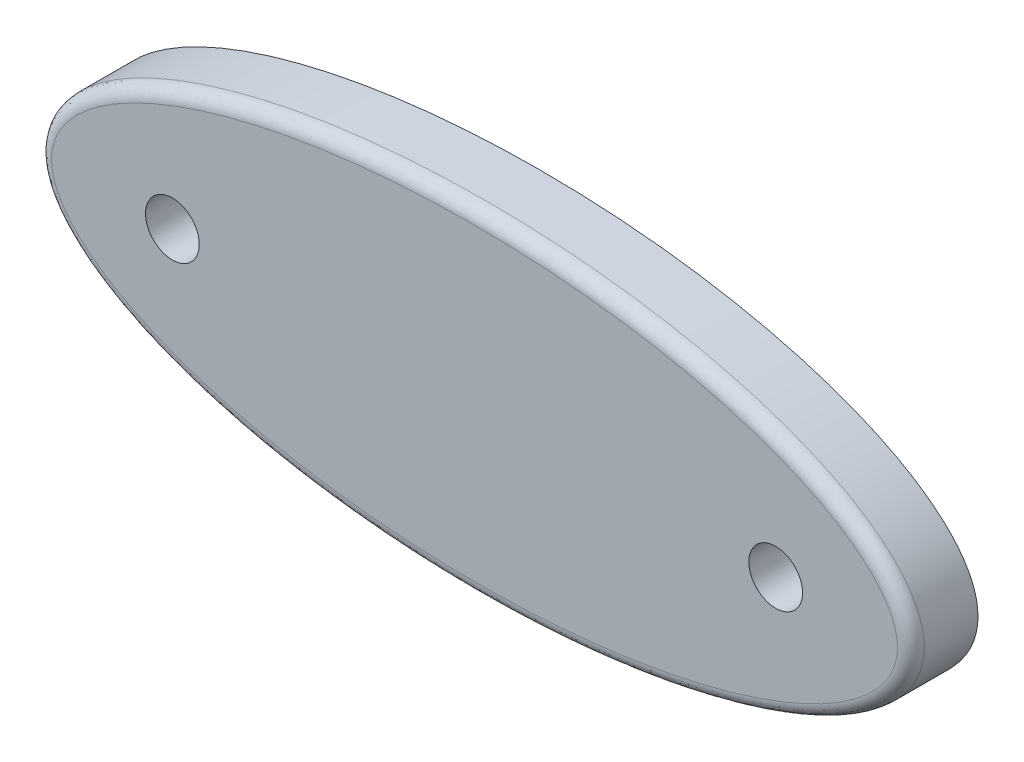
ISO-10303-21;
HEADER;
FILE_DESCRIPTION(('STEP AP214'),'2;1');
FILE_NAME('part.step','',(''),(''),'','','');
FILE_SCHEMA(('AUTOMOTIVE_DESIGN { 1 0 10303 214 1 1 1 1 }'));
ENDSEC;
DATA;
#1=APPLICATION_CONTEXT('core data for automotive mechanical design processes');
#2=APPLICATION_PROTOCOL_DEFINITION('international standard','automotive_design',2000,#1);
#3=PRODUCT_CONTEXT('',#1,'mechanical');
#4=PRODUCT('Part','Part','',(#3));
#5=PRODUCT_RELATED_PRODUCT_CATEGORY('part','',(#4));
#6=PRODUCT_DEFINITION_FORMATION('','',#4);
#7=PRODUCT_DEFINITION_CONTEXT('part definition',#1,'design');
#8=PRODUCT_DEFINITION('design','',#6,#7);
#9=PRODUCT_DEFINITION_SHAPE('','',#8);
#10=(LENGTH_UNIT() NAMED_UNIT(*) SI_UNIT(.MILLI.,.METRE.));
#11=(NAMED_UNIT(*) PLANE_ANGLE_UNIT() SI_UNIT($,.RADIAN.));
#12=(NAMED_UNIT(*) SI_UNIT($,.STERADIAN.) SOLID_ANGLE_UNIT());
#13=UNCERTAINTY_MEASURE_WITH_UNIT(LENGTH_MEASURE(1.E-05),#10,'distance_accuracy_value','');
#14=(GEOMETRIC_REPRESENTATION_CONTEXT(3) GLOBAL_UNCERTAINTY_ASSIGNED_CONTEXT((#13)) GLOBAL_UNIT_ASSIGNED_CONTEXT((#10,
#11,#12)) REPRESENTATION_CONTEXT('',''));
#15=CARTESIAN_POINT('',(0.,0.,0.));
#16=DIRECTION('',(0.,0.,1.));
#17=DIRECTION('',(1.,0.,0.));
#18=AXIS2_PLACEMENT_3D('',#15,#16,#17);
#19=CARTESIAN_POINT('',(0.,0.,0.));
#20=DIRECTION('',(0.,0.,1.));
#21=DIRECTION('',(1.,0.,0.));
#22=AXIS2_PLACEMENT_3D('',#19,#20,#21);
#23=PLANE('',#22);
#24=CARTESIAN_POINT('',(-45.,0.,0.));
#25=DIRECTION('',(0.,0.,1.));
#26=DIRECTION('',(1.,0.,0.));
#27=AXIS2_PLACEMENT_3D('',#24,#25,#26);
#28=CIRCLE('',#27,2.);
#29=CARTESIAN_POINT('',(-43.,0.,0.));
#30=VERTEX_POINT('',#29);
#31=EDGE_CURVE('E139',#30,#30,#28,.T.);
#32=ORIENTED_EDGE('',*,*,#31,.T.);
#33=EDGE_LOOP('',(#32));
#34=FACE_BOUND('',#33,.T.);
#35=CARTESIAN_POINT('',(0.,0.,0.));
#36=DIRECTION('',(0.,0.,1.));
#37=DIRECTION('',(-1.,0.,0.));
#38=AXIS2_PLACEMENT_3D('',#35,#36,#37);
#39=ELLIPSE('',#38,65.,25.);
#40=CARTESIAN_POINT('',(-65.,0.,0.));
#41=VERTEX_POINT('',#40);
#42=EDGE_CURVE('E134',#41,#41,#39,.T.);
#43=ORIENTED_EDGE('',*,*,#42,.F.);
#44=EDGE_LOOP('',(#43));
#45=FACE_BOUND('',#44,.T.);
#46=CARTESIAN_POINT('',(45.,0.,0.));
#47=DIRECTION('',(0.,0.,1.));
#48=DIRECTION('',(1.,0.,0.));
#49=AXIS2_PLACEMENT_3D('',#46,#47,#48);
#50=CIRCLE('',#49,2.);
#51=CARTESIAN_POINT('',(47.,0.,0.));
#52=VERTEX_POINT('',#51);
#53=EDGE_CURVE('E151',#52,#52,#50,.T.);
#54=ORIENTED_EDGE('',*,*,#53,.T.);
#55=EDGE_LOOP('',(#54));
#56=FACE_BOUND('',#55,.T.);
#57=CARTESIAN_POINT('',(0.,-1.11803398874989,0.));
#58=DIRECTION('',(0.,0.,1.));
#59=DIRECTION('',(-1.,0.,0.));
#60=AXIS2_PLACEMENT_3D('',#57,#58,#59);
#61=CIRCLE('',#60,0.5);
#62=CARTESIAN_POINT('',(0.333333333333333,-0.74535599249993,0.));
#63=VERTEX_POINT('',#62);
#64=CARTESIAN_POINT('',(-0.333333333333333,-0.74535599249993,0.));
#65=VERTEX_POINT('',#64);
#66=EDGE_CURVE('E73',#63,#65,#61,.T.);
#67=ORIENTED_EDGE('',*,*,#66,.F.);
#68=CARTESIAN_POINT('',(1.,0.,0.));
#69=DIRECTION('',(0.,0.,-1.));
#70=DIRECTION('',(-1.,0.,0.));
#71=AXIS2_PLACEMENT_3D('',#68,#69,#70);
#72=CIRCLE('',#71,1.);
#73=CARTESIAN_POINT('',(0.333333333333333,0.74535599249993,0.));
#74=VERTEX_POINT('',#73);
#75=EDGE_CURVE('E75',#74,#63,#72,.T.);
#76=ORIENTED_EDGE('',*,*,#75,.F.);
#77=CARTESIAN_POINT('',(0.,1.11803398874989,0.));
#78=DIRECTION('',(0.,0.,1.));
#79=DIRECTION('',(-1.,0.,0.));
#80=AXIS2_PLACEMENT_3D('',#77,#78,#79);
#81=CIRCLE('',#80,0.5);
#82=CARTESIAN_POINT('',(-0.333333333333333,0.74535599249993,0.));
#83=VERTEX_POINT('',#82);
#84=EDGE_CURVE('E56',#83,#74,#81,.T.);
#85=ORIENTED_EDGE('',*,*,#84,.F.);
#86=CARTESIAN_POINT('',(-1.,0.,0.));
#87=DIRECTION('',(0.,0.,-1.));
#88=DIRECTION('',(-1.,0.,0.));
#89=AXIS2_PLACEMENT_3D('',#86,#87,#88);
#90=CIRCLE('',#89,1.);
#91=EDGE_CURVE('E51',#65,#83,#90,.T.);
#92=ORIENTED_EDGE('',*,*,#91,.F.);
#93=EDGE_LOOP('',(#67,#76,#85,#92));
#94=FACE_BOUND('',#93,.T.);
#95=ADVANCED_FACE('F32',(#34,#45,#56,#94),#23,.F.);
#96=CARTESIAN_POINT('',(45.,0.,10.));
#97=DIRECTION('',(0.,0.,-1.));
#98=DIRECTION('',(-1.,0.,0.));
#99=AXIS2_PLACEMENT_3D('',#96,#97,#98);
#100=CYLINDRICAL_SURFACE('',#99,2.);
#101=ORIENTED_EDGE('',*,*,#53,.F.);
#102=EDGE_LOOP('',(#101));
#103=FACE_BOUND('',#102,.T.);
#104=CARTESIAN_POINT('',(45.,0.,4.));
#105=DIRECTION('',(0.,0.,1.));
#106=DIRECTION('',(1.,0.,0.));
#107=AXIS2_PLACEMENT_3D('',#104,#105,#106);
#108=CIRCLE('',#107,2.);
#109=CARTESIAN_POINT('',(47.,0.,4.));
#110=VERTEX_POINT('',#109);
#111=EDGE_CURVE('E141',#110,#110,#108,.T.);
#112=ORIENTED_EDGE('',*,*,#111,.T.);
#113=EDGE_LOOP('',(#112));
#114=FACE_BOUND('',#113,.T.);
#115=ADVANCED_FACE('F188',(#103,#114),#100,.F.);
#116=CARTESIAN_POINT('',(-45.,0.,10.));
#117=DIRECTION('',(0.,0.,-1.));
#118=DIRECTION('',(-1.,0.,0.));
#119=AXIS2_PLACEMENT_3D('',#116,#117,#118);
#120=CYLINDRICAL_SURFACE('',#119,2.);
#121=ORIENTED_EDGE('',*,*,#31,.F.);
#122=EDGE_LOOP('',(#121));
#123=FACE_BOUND('',#122,.T.);
#124=CARTESIAN_POINT('',(-45.,0.,4.));
#125=DIRECTION('',(0.,0.,1.));
#126=DIRECTION('',(1.,0.,0.));
#127=AXIS2_PLACEMENT_3D('',#124,#125,#126);
#128=CIRCLE('',#127,2.);
#129=CARTESIAN_POINT('',(-43.,0.,4.));
#130=VERTEX_POINT('',#129);
#131=EDGE_CURVE('E136',#130,#130,#128,.T.);
#132=ORIENTED_EDGE('',*,*,#131,.T.);
#133=EDGE_LOOP('',(#132));
#134=FACE_BOUND('',#133,.T.);
#135=ADVANCED_FACE('F173',(#123,#134),#120,.F.);
#136=CARTESIAN_POINT('',(0.,0.,10.));
#137=DIRECTION('',(0.,0.,1.));
#138=DIRECTION('',(1.,0.,0.));
#139=AXIS2_PLACEMENT_3D('',#136,#137,#138);
#140=PLANE('',#139);
#141=CARTESIAN_POINT('',(-62.2490226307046,-3.38661027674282,10.));
#142=CARTESIAN_POINT('',(-64.0778378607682,-4.19619958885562,10.));
#143=CARTESIAN_POINT('',(-64.0778378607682,-4.19619958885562,8.));
#144=CARTESIAN_POINT('',(-62.3623812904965,-3.13053551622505,10.));
#145=CARTESIAN_POINT('',(-64.2137592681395,-3.88915429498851,10.));
#146=CARTESIAN_POINT('',(-64.2137592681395,-3.88915429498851,8.));
#147=CARTESIAN_POINT('',(-62.4650469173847,-2.86968605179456,10.));
#148=CARTESIAN_POINT('',(-64.3381214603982,-3.57355492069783,10.));
#149=CARTESIAN_POINT('',(-64.3381214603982,-3.57355492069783,8.));
#150=CARTESIAN_POINT('',(-62.6457625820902,-2.33952714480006,10.));
#151=CARTESIAN_POINT('',(-64.5587586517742,-2.92626639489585,10.));
#152=CARTESIAN_POINT('',(-64.5587586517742,-2.92626639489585,8.));
#153=CARTESIAN_POINT('',(-62.7238138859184,-2.07021813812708,10.));
#154=CARTESIAN_POINT('',(-64.6550350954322,-2.5945780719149,10.));
#155=CARTESIAN_POINT('',(-64.6550350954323,-2.59457807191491,8.));
#156=CARTESIAN_POINT('',(-62.8521002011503,-1.52572354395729,10.));
#157=CARTESIAN_POINT('',(-64.8142283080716,-1.91887720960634,10.));
#158=CARTESIAN_POINT('',(-64.8142283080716,-1.91887720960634,8.));
#159=CARTESIAN_POINT('',(-62.9024068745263,-1.25055502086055,10.));
#160=CARTESIAN_POINT('',(-64.8772310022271,-1.57489888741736,10.));
#161=CARTESIAN_POINT('',(-64.8772310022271,-1.57489888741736,8.));
#162=CARTESIAN_POINT('',(-62.9731897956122,-0.696406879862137,10.));
#163=CARTESIAN_POINT('',(-64.9661173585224,-0.878961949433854,10.));
#164=CARTESIAN_POINT('',(-64.9661173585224,-0.878961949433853,8.));
#165=CARTESIAN_POINT('',(-62.9936730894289,-0.417428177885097,10.));
#166=CARTESIAN_POINT('',(-64.9920097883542,-0.527005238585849,10.));
#167=CARTESIAN_POINT('',(-64.9920097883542,-0.527005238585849,8.));
#168=CARTESIAN_POINT('',(-63.0030637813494,0.0994618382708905,10.));
#169=CARTESIAN_POINT('',(-65.0038700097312,0.125552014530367,10.));
#170=CARTESIAN_POINT('',(-65.0038700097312,0.125552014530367,8.));
#171=CARTESIAN_POINT('',(-62.996217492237,0.337304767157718,10.));
#172=CARTESIAN_POINT('',(-64.9952069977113,0.425998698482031,10.));
#173=CARTESIAN_POINT('',(-64.9952069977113,0.425998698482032,8.));
#174=CARTESIAN_POINT('',(-62.9604771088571,0.81129875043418,10.));
#175=CARTESIAN_POINT('',(-64.9501663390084,1.0233404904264,10.));
#176=CARTESIAN_POINT('',(-64.9501663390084,1.0233404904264,8.));
#177=CARTESIAN_POINT('',(-62.931585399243,1.04744998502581,10.));
#178=CARTESIAN_POINT('',(-64.9137916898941,1.32023597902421,10.));
#179=CARTESIAN_POINT('',(-64.9137916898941,1.32023597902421,8.));
#180=CARTESIAN_POINT('',(-62.8527193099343,1.51648920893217,10.));
#181=CARTESIAN_POINT('',(-64.8151224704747,1.9070706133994,10.));
#182=CARTESIAN_POINT('',(-64.8151224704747,1.9070706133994,8.));
#183=CARTESIAN_POINT('',(-62.8027175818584,1.74937255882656,10.));
#184=CARTESIAN_POINT('',(-64.7527942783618,2.19700021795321,10.));
#185=CARTESIAN_POINT('',(-64.7527942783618,2.19700021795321,8.));
#186=CARTESIAN_POINT('',(-62.6832180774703,2.21007134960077,10.));
#187=CARTESIAN_POINT('',(-64.6049974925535,2.76679933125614,10.));
#188=CARTESIAN_POINT('',(-64.6049974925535,2.76679933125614,8.));
#189=CARTESIAN_POINT('',(-62.6137170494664,2.43788593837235,10.));
#190=CARTESIAN_POINT('',(-64.5195250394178,3.04666715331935,10.));
#191=CARTESIAN_POINT('',(-64.5195250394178,3.04666715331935,8.));
#192=CARTESIAN_POINT('',(-62.4355590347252,2.94918153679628,10.));
#193=CARTESIAN_POINT('',(-64.3022935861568,3.67011172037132,10.));
#194=CARTESIAN_POINT('',(-64.3022935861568,3.67011172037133,8.));
#195=CARTESIAN_POINT('',(-62.3213901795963,3.23074270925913,10.));
#196=CARTESIAN_POINT('',(-64.1642696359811,4.01004390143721,10.));
#197=CARTESIAN_POINT('',(-64.1642696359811,4.01004390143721,8.));
#198=CARTESIAN_POINT('',(-62.0684918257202,3.782574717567,10.));
#199=CARTESIAN_POINT('',(-63.861901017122,4.66982831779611,10.));
#200=CARTESIAN_POINT('',(-63.861901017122,4.66982831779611,8.));
#201=CARTESIAN_POINT('',(-61.9297545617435,4.05284195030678,10.));
#202=CARTESIAN_POINT('',(-63.6975480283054,4.98967416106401,10.));
#203=CARTESIAN_POINT('',(-63.6975480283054,4.98967416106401,8.));
#204=CARTESIAN_POINT('',(-61.6313207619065,4.58199275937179,10.));
#205=CARTESIAN_POINT('',(-63.3475732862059,5.61021106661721,10.));
#206=CARTESIAN_POINT('',(-63.3475732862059,5.61021106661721,8.));
#207=CARTESIAN_POINT('',(-61.4715932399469,4.84085873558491,10.));
#208=CARTESIAN_POINT('',(-63.1619201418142,5.91087281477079,10.));
#209=CARTESIAN_POINT('',(-63.1619201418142,5.91087281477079,8.));
#210=CARTESIAN_POINT('',(-61.1345883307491,5.34698048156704,10.));
#211=CARTESIAN_POINT('',(-62.7736901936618,6.49392470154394,10.));
#212=CARTESIAN_POINT('',(-62.7736901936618,6.49392470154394,8.));
#213=CARTESIAN_POINT('',(-60.9573038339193,5.59423148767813,10.));
#214=CARTESIAN_POINT('',(-62.5711065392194,6.77630736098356,10.));
#215=CARTESIAN_POINT('',(-62.5711065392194,6.77630736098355,8.));
#216=CARTESIAN_POINT('',(-60.6118771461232,6.04621350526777,10.));
#217=CARTESIAN_POINT('',(-62.1794037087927,7.28883815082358,10.));
#218=CARTESIAN_POINT('',(-62.1794037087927,7.28883815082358,8.));
#219=CARTESIAN_POINT('',(-60.445511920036,6.25231152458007,10.));
#220=CARTESIAN_POINT('',(-61.9919253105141,7.52102194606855,10.));
#221=CARTESIAN_POINT('',(-61.9919253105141,7.52102194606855,8.));
#222=CARTESIAN_POINT('',(-60.1031175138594,6.65634041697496,10.));
#223=CARTESIAN_POINT('',(-61.6083072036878,7.97369237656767,10.));
#224=CARTESIAN_POINT('',(-61.6083072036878,7.97369237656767,8.));
#225=CARTESIAN_POINT('',(-59.9270867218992,6.85426991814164,10.));
#226=CARTESIAN_POINT('',(-61.4121660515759,8.19417704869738,10.));
#227=CARTESIAN_POINT('',(-61.4121660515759,8.19417704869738,8.));
#228=CARTESIAN_POINT('',(-59.3862934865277,7.43661612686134,10.));
#229=CARTESIAN_POINT('',(-60.8126303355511,8.83979430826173,10.));
#230=CARTESIAN_POINT('',(-60.8126303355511,8.83979430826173,8.));
#231=CARTESIAN_POINT('',(-59.0089669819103,7.80941519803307,10.));
#232=CARTESIAN_POINT('',(-60.3982784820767,9.24889222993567,10.));
#233=CARTESIAN_POINT('',(-60.3982784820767,9.24889222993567,8.));
#234=CARTESIAN_POINT('',(-58.2282046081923,8.52795473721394,10.));
#235=CARTESIAN_POINT('',(-59.547551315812,10.0318041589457,10.));
#236=CARTESIAN_POINT('',(-59.547551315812,10.0318041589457,8.));
#237=CARTESIAN_POINT('',(-57.8247140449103,8.87363495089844,10.));
#238=CARTESIAN_POINT('',(-59.1111303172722,10.405539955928,10.));
#239=CARTESIAN_POINT('',(-59.1111303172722,10.405539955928,8.));
#240=CARTESIAN_POINT('',(-56.997995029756,9.54017713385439,10.));
#241=CARTESIAN_POINT('',(-58.2222306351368,11.1222129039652,10.));
#242=CARTESIAN_POINT('',(-58.2222306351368,11.1222129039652,8.));
#243=CARTESIAN_POINT('',(-56.5747714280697,9.86104515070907,10.));
#244=CARTESIAN_POINT('',(-57.7697559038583,11.4651575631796,10.));
#245=CARTESIAN_POINT('',(-57.7697559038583,11.4651575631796,8.));
#246=CARTESIAN_POINT('',(-55.6750340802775,10.5077599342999,10.));
#247=CARTESIAN_POINT('',(-56.81224850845,12.1533946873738,10.));
#248=CARTESIAN_POINT('',(-56.81224850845,12.1533946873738,8.));
#249=CARTESIAN_POINT('',(-55.1970894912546,10.831606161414,10.));
#250=CARTESIAN_POINT('',(-56.3060706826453,12.4962899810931,10.));
#251=CARTESIAN_POINT('',(-56.3060706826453,12.4962899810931,8.));
#252=CARTESIAN_POINT('',(-54.2263214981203,11.4563034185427,10.));
#253=CARTESIAN_POINT('',(-55.2819267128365,13.1553326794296,10.));
#254=CARTESIAN_POINT('',(-55.2819267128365,13.1553326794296,8.));
#255=CARTESIAN_POINT('',(-53.7334945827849,11.757148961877,10.));
#256=CARTESIAN_POINT('',(-54.7639577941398,13.4714737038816,10.));
#257=CARTESIAN_POINT('',(-54.7639577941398,13.4714737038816,8.));
#258=CARTESIAN_POINT('',(-52.73543957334,12.3384703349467,10.));
#259=CARTESIAN_POINT('',(-53.718177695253,14.0805918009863,10.));
#260=CARTESIAN_POINT('',(-53.718177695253,14.0805918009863,8.));
#261=CARTESIAN_POINT('',(-52.2302009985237,12.618928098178,10.));
#262=CARTESIAN_POINT('',(-53.1903582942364,14.3735483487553,10.));
#263=CARTESIAN_POINT('',(-53.1903582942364,14.3735483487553,8.));
#264=CARTESIAN_POINT('',(-51.2098335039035,13.1612526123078,10.));
#265=CARTESIAN_POINT('',(-52.1269871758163,14.9387285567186,10.));
#266=CARTESIAN_POINT('',(-52.1269871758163,14.9387285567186,8.));
#267=CARTESIAN_POINT('',(-50.6947039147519,13.4231180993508,10.));
#268=CARTESIAN_POINT('',(-51.5914349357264,15.2109508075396,10.));
#269=CARTESIAN_POINT('',(-51.5914349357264,15.2109508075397,8.));
#270=CARTESIAN_POINT('',(-49.6554384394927,13.930339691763,10.));
#271=CARTESIAN_POINT('',(-50.5131101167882,15.7372352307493,10.));
#272=CARTESIAN_POINT('',(-50.5131101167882,15.7372352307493,8.));
#273=CARTESIAN_POINT('',(-49.1312901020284,14.1756702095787,10.));
#274=CARTESIAN_POINT('',(-49.9703278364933,15.9912692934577,10.));
#275=CARTESIAN_POINT('',(-49.9703278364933,15.9912692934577,8.));
#276=CARTESIAN_POINT('',(-48.0760336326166,14.6508441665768,10.));
#277=CARTESIAN_POINT('',(-48.8793441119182,16.4825306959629,10.));
#278=CARTESIAN_POINT('',(-48.8793441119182,16.4825306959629,8.));
#279=CARTESIAN_POINT('',(-47.5449254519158,14.880687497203,10.));
#280=CARTESIAN_POINT('',(-48.3311426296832,16.7197579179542,10.));
#281=CARTESIAN_POINT('',(-48.3311426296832,16.7197579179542,8.));
#282=CARTESIAN_POINT('',(-46.4770363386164,15.3260138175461,10.));
#283=CARTESIAN_POINT('',(-47.2303874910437,17.1787897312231,10.));
#284=CARTESIAN_POINT('',(-47.2303874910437,17.1787897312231,8.));
#285=CARTESIAN_POINT('',(-45.9402582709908,15.5415036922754,10.));
#286=CARTESIAN_POINT('',(-46.6778360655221,17.4006017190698,10.));
#287=CARTESIAN_POINT('',(-46.6778360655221,17.4006017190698,8.));
#288=CARTESIAN_POINT('',(-44.8615942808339,15.9593017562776,10.));
#289=CARTESIAN_POINT('',(-45.5687500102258,17.8301829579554,10.));
#290=CARTESIAN_POINT('',(-45.5687500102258,17.8301829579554,8.));
#291=CARTESIAN_POINT('',(-44.319708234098,16.1616096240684,10.));
#292=CARTESIAN_POINT('',(-45.0122152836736,18.0379518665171,10.));
#293=CARTESIAN_POINT('',(-45.0122152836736,18.0379518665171,8.));
#294=CARTESIAN_POINT('',(-43.1202049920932,16.5940846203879,10.));
#295=CARTESIAN_POINT('',(-43.7814872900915,18.4816850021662,10.));
#296=CARTESIAN_POINT('',(-43.7814872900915,18.4816850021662,8.));
#297=CARTESIAN_POINT('',(-42.461589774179,16.8214846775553,10.));
#298=CARTESIAN_POINT('',(-43.1065147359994,18.7147223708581,10.));
#299=CARTESIAN_POINT('',(-43.1065147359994,18.7147223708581,8.));
#300=CARTESIAN_POINT('',(-41.1388935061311,17.2598289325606,10.));
#301=CARTESIAN_POINT('',(-41.7522919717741,19.1635139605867,10.));
#302=CARTESIAN_POINT('',(-41.7522919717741,19.1635139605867,8.));
#303=CARTESIAN_POINT('',(-40.4748121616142,17.4707722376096,10.));
#304=CARTESIAN_POINT('',(-41.0730415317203,19.3792672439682,10.));
#305=CARTESIAN_POINT('',(-41.0730415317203,19.3792672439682,8.));
#306=CARTESIAN_POINT('',(-38.4753422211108,18.0807467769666,10.));
#307=CARTESIAN_POINT('',(-39.0295667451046,20.002668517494,10.));
#308=CARTESIAN_POINT('',(-39.0295667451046,20.002668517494,8.));
#309=CARTESIAN_POINT('',(-37.1329163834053,18.4568554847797,10.));
#310=CARTESIAN_POINT('',(-37.6598123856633,20.3863891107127,10.));
#311=CARTESIAN_POINT('',(-37.6598123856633,20.3863891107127,8.));
#312=CARTESIAN_POINT('',(-34.4328612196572,19.1555396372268,10.));
#313=CARTESIAN_POINT('',(-34.908025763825,21.0984567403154,10.));
#314=CARTESIAN_POINT('',(-34.908025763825,21.0984567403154,8.));
#315=CARTESIAN_POINT('',(-33.0752173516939,19.4780582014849,10.));
#316=CARTESIAN_POINT('',(-33.5259820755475,21.4267449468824,10.));
#317=CARTESIAN_POINT('',(-33.5259820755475,21.4267449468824,8.));
#318=CARTESIAN_POINT('',(-30.3494440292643,20.0744377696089,10.));
#319=CARTESIAN_POINT('',(-30.7536325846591,22.033314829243,10.));
#320=CARTESIAN_POINT('',(-30.7536325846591,22.033314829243,8.));
#321=CARTESIAN_POINT('',(-28.981315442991,20.3483027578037,10.));
#322=CARTESIAN_POINT('',(-29.3633274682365,22.3116005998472,10.));
#323=CARTESIAN_POINT('',(-29.3633274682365,22.3116005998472,8.));
#324=CARTESIAN_POINT('',(-26.230431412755,20.8526574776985,10.));
#325=CARTESIAN_POINT('',(-26.569671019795,22.8237968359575,10.));
#326=CARTESIAN_POINT('',(-26.569671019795,22.8237968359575,8.));
#327=CARTESIAN_POINT('',(-24.8476373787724,21.0829355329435,10.));
#328=CARTESIAN_POINT('',(-25.1662890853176,23.0574907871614,10.));
#329=CARTESIAN_POINT('',(-25.1662890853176,23.0574907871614,8.));
#330=CARTESIAN_POINT('',(-22.075740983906,21.5016211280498,10.));
#331=CARTESIAN_POINT('',(-22.3545025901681,23.4822014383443,10.));
#332=CARTESIAN_POINT('',(-22.3545025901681,23.4822014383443,8.));
#333=CARTESIAN_POINT('',(-20.6866385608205,21.6900282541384,10.));
#334=CARTESIAN_POINT('',(-20.9460979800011,23.6732177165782,10.));
#335=CARTESIAN_POINT('',(-20.9460979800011,23.6732177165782,8.));
#336=CARTESIAN_POINT('',(-17.9045064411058,22.0272220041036,10.));
#337=CARTESIAN_POINT('',(-18.1263363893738,24.0149720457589,10.));
#338=CARTESIAN_POINT('',(-18.1263363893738,24.0149720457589,8.));
#339=CARTESIAN_POINT('',(-16.5114796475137,22.1760326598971,10.));
#340=CARTESIAN_POINT('',(-16.7149817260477,24.1657345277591,10.));
#341=CARTESIAN_POINT('',(-16.7149817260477,24.1657345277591,8.));
#342=CARTESIAN_POINT('',(-13.7218962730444,22.4359170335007,10.));
#343=CARTESIAN_POINT('',(-13.8894438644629,24.4289682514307,10.));
#344=CARTESIAN_POINT('',(-13.8894438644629,24.4289682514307,8.));
#345=CARTESIAN_POINT('',(-12.3253395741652,22.5469894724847,10.));
#346=CARTESIAN_POINT('',(-12.4752605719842,24.5414381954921,10.));
#347=CARTESIAN_POINT('',(-12.4752605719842,24.5414381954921,8.));
#348=CARTESIAN_POINT('',(-8.74265329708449,22.7849454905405,10.));
#349=CARTESIAN_POINT('',(-8.84800843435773,24.7823550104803,10.));
#350=CARTESIAN_POINT('',(-8.84800843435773,24.7823550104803,8.));
#351=CARTESIAN_POINT('',(-6.55473105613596,22.8855142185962,10.));
#352=CARTESIAN_POINT('',(-6.63349193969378,24.8841372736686,10.));
#353=CARTESIAN_POINT('',(-6.63349193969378,24.8841372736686,8.));
#354=CARTESIAN_POINT('',(-2.17649883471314,23.0002290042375,10.));
#355=CARTESIAN_POINT('',(-2.20251248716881,25.0002335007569,10.));
#356=CARTESIAN_POINT('',(-2.20251248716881,25.0002335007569,8.));
#357=CARTESIAN_POINT('',(0.0138113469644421,23.0143671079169,10.));
#358=CARTESIAN_POINT('',(0.0139506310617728,25.0145394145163,10.));
#359=CARTESIAN_POINT('',(0.0139506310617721,25.0145394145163,8.));
#360=CARTESIAN_POINT('',(4.3964212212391,22.9565072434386,10.));
#361=CARTESIAN_POINT('',(4.44912596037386,24.9559858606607,10.));
#362=CARTESIAN_POINT('',(4.44912596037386,24.9559858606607,8.));
#363=CARTESIAN_POINT('',(6.5887193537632,22.8843875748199,10.));
#364=CARTESIAN_POINT('',(6.66783692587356,24.8830032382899,10.));
#365=CARTESIAN_POINT('',(6.66783692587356,24.8830032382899,8.));
#366=CARTESIAN_POINT('',(10.9684899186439,22.6519540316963,10.));
#367=CARTESIAN_POINT('',(11.1013527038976,24.6477174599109,10.));
#368=CARTESIAN_POINT('',(11.1013527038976,24.6477174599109,8.));
#369=CARTESIAN_POINT('',(13.1559626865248,22.4916464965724,10.));
#370=CARTESIAN_POINT('',(13.3161577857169,24.4854207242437,10.));
#371=CARTESIAN_POINT('',(13.3161577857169,24.4854207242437,8.));
#372=CARTESIAN_POINT('',(17.5047997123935,22.0801881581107,10.));
#373=CARTESIAN_POINT('',(17.7211687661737,24.068649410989,10.));
#374=CARTESIAN_POINT('',(17.7211687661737,24.068649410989,8.));
#375=CARTESIAN_POINT('',(19.6662325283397,21.829777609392,10.));
#376=CARTESIAN_POINT('',(19.9114293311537,23.8149259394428,10.));
#377=CARTESIAN_POINT('',(19.9114293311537,23.8149259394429,8.));
#378=CARTESIAN_POINT('',(22.8982926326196,21.3804065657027,10.));
#379=CARTESIAN_POINT('',(23.1888027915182,23.3592531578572,10.));
#380=CARTESIAN_POINT('',(23.1888027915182,23.3592531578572,8.));
#381=CARTESIAN_POINT('',(23.9741285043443,21.2182931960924,10.));
#382=CARTESIAN_POINT('',(24.28009092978,23.1948166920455,10.));
#383=CARTESIAN_POINT('',(24.28009092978,23.1948166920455,8.));
#384=CARTESIAN_POINT('',(26.1215621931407,20.8681634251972,10.));
#385=CARTESIAN_POINT('',(26.4592936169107,22.8395074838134,10.));
#386=CARTESIAN_POINT('',(26.4592936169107,22.8395074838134,8.));
#387=CARTESIAN_POINT('',(27.1931601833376,20.6801480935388,10.));
#388=CARTESIAN_POINT('',(27.5472083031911,22.6486358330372,10.));
#389=CARTESIAN_POINT('',(27.5472083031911,22.6486358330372,8.));
#390=CARTESIAN_POINT('',(29.3289025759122,20.2770822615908,10.));
#391=CARTESIAN_POINT('',(29.7166191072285,22.2392160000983,10.));
#392=CARTESIAN_POINT('',(29.7166191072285,22.2392160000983,8.));
#393=CARTESIAN_POINT('',(30.3930580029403,20.0620902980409,10.));
#394=CARTESIAN_POINT('',(30.7981239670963,22.0207277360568,10.));
#395=CARTESIAN_POINT('',(30.7981239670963,22.0207277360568,8.));
#396=CARTESIAN_POINT('',(32.5150991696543,19.6028043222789,10.));
#397=CARTESIAN_POINT('',(32.9561894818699,21.5536450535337,10.));
#398=CARTESIAN_POINT('',(32.9561894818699,21.5536450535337,8.));
#399=CARTESIAN_POINT('',(33.5729846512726,19.3585091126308,10.));
#400=CARTESIAN_POINT('',(34.0327499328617,21.305049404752,10.));
#401=CARTESIAN_POINT('',(34.0327499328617,21.305049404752,8.));
#402=CARTESIAN_POINT('',(35.6804193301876,18.8383418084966,10.));
#403=CARTESIAN_POINT('',(36.1791796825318,20.7752572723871,10.));
#404=CARTESIAN_POINT('',(36.1791796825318,20.7752572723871,8.));
#405=CARTESIAN_POINT('',(36.7299724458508,18.5624856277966,10.));
#406=CARTESIAN_POINT('',(37.2490520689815,20.494077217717,10.));
#407=CARTESIAN_POINT('',(37.2490520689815,20.494077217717,8.));
#408=CARTESIAN_POINT('',(38.8192822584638,17.9761043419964,10.));
#409=CARTESIAN_POINT('',(39.381081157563,19.8957075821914,10.));
#410=CARTESIAN_POINT('',(39.381081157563,19.8957075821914,8.));
#411=CARTESIAN_POINT('',(39.8590402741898,17.6655839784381,10.));
#412=CARTESIAN_POINT('',(40.4432388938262,19.5785229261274,10.));
#413=CARTESIAN_POINT('',(40.4432388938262,19.5785229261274,8.));
#414=CARTESIAN_POINT('',(41.2562084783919,17.2197917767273,10.));
#415=CARTESIAN_POINT('',(41.8724877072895,19.1224939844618,10.));
#416=CARTESIAN_POINT('',(41.8724877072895,19.1224939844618,8.));
#417=CARTESIAN_POINT('',(41.6190452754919,17.1013941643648,10.));
#418=CARTESIAN_POINT('',(42.2438381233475,19.0013199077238,10.));
#419=CARTESIAN_POINT('',(42.2438381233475,19.0013199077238,8.));
#420=CARTESIAN_POINT('',(42.3430490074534,16.8596223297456,10.));
#421=CARTESIAN_POINT('',(42.9852319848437,18.753740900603,10.));
#422=CARTESIAN_POINT('',(42.9852319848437,18.753740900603,8.));
#423=CARTESIAN_POINT('',(42.7042159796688,16.7362482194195,10.));
#424=CARTESIAN_POINT('',(43.3552754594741,18.6273360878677,10.));
#425=CARTESIAN_POINT('',(43.3552754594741,18.6273360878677,8.));
#426=CARTESIAN_POINT('',(43.7850171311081,16.3583352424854,10.));
#427=CARTESIAN_POINT('',(44.4633019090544,18.2399039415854,10.));
#428=CARTESIAN_POINT('',(44.4633019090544,18.2399039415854,8.));
#429=CARTESIAN_POINT('',(44.5019499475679,16.0960062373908,10.));
#430=CARTESIAN_POINT('',(45.19917927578,17.9706594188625,10.));
#431=CARTESIAN_POINT('',(45.19917927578,17.9706594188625,8.));
#432=CARTESIAN_POINT('',(45.9289317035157,15.5478916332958,10.));
#433=CARTESIAN_POINT('',(46.6660229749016,17.4072342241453,10.));
#434=CARTESIAN_POINT('',(46.6660229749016,17.4072342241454,8.));
#435=CARTESIAN_POINT('',(46.6389582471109,15.262047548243,10.));
#436=CARTESIAN_POINT('',(47.3969718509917,17.1129913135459,10.));
#437=CARTESIAN_POINT('',(47.3969718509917,17.112991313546,8.));
#438=CARTESIAN_POINT('',(48.0482780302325,14.6650374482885,10.));
#439=CARTESIAN_POINT('',(48.8505043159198,16.4972514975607,10.));
#440=CARTESIAN_POINT('',(48.8505043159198,16.4972514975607,8.));
#441=CARTESIAN_POINT('',(48.7475716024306,14.3538722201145,10.));
#442=CARTESIAN_POINT('',(49.573088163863,16.175755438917,10.));
#443=CARTESIAN_POINT('',(49.573088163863,16.175755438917,8.));
#444=CARTESIAN_POINT('',(50.2336896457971,13.6558703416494,10.));
#445=CARTESIAN_POINT('',(51.1123190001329,15.452813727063,10.));
#446=CARTESIAN_POINT('',(51.1123190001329,15.452813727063,8.));
#447=CARTESIAN_POINT('',(51.0184618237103,13.2646088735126,10.));
#448=CARTESIAN_POINT('',(51.927371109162,15.0465396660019,10.));
#449=CARTESIAN_POINT('',(51.927371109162,15.0465396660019,8.));
#450=CARTESIAN_POINT('',(52.1785996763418,12.6454139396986,10.));
#451=CARTESIAN_POINT('',(53.1366846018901,14.4010939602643,10.));
#452=CARTESIAN_POINT('',(53.1366846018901,14.4010939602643,8.));
#453=CARTESIAN_POINT('',(52.5625887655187,12.4335630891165,10.));
#454=CARTESIAN_POINT('',(53.5376972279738,14.1798674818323,10.));
#455=CARTESIAN_POINT('',(53.5376972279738,14.1798674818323,8.));
#456=CARTESIAN_POINT('',(53.3238880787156,11.9982057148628,10.));
#457=CARTESIAN_POINT('',(54.3344827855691,13.7242179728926,10.));
#458=CARTESIAN_POINT('',(54.3344827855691,13.7242179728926,8.));
#459=CARTESIAN_POINT('',(53.7011988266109,11.7747001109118,10.));
#460=CARTESIAN_POINT('',(54.7302561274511,13.4897959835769,10.));
#461=CARTESIAN_POINT('',(54.7302561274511,13.4897959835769,8.));
#462=CARTESIAN_POINT('',(54.4466126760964,11.3158924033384,10.));
#463=CARTESIAN_POINT('',(55.5141735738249,13.0072891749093,10.));
#464=CARTESIAN_POINT('',(55.5141735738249,13.0072891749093,8.));
#465=CARTESIAN_POINT('',(54.8147454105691,11.0806385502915,10.));
#466=CARTESIAN_POINT('',(55.9023410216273,12.7592598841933,10.));
#467=CARTESIAN_POINT('',(55.9023410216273,12.7592598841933,8.));
#468=CARTESIAN_POINT('',(55.5418485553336,10.5964268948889,10.));
#469=CARTESIAN_POINT('',(56.67139493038,12.2471120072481,10.));
#470=CARTESIAN_POINT('',(56.67139493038,12.2471120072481,8.));
#471=CARTESIAN_POINT('',(55.90082013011,10.3474708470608,10.));
#472=CARTESIAN_POINT('',(57.0522823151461,11.9829954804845,10.));
#473=CARTESIAN_POINT('',(57.0522823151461,11.9829954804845,8.));
#474=CARTESIAN_POINT('',(56.6075692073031,9.83473128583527,10.));
#475=CARTESIAN_POINT('',(57.805000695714,11.4369062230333,10.));
#476=CARTESIAN_POINT('',(57.805000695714,11.4369062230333,8.));
#477=CARTESIAN_POINT('',(56.9553562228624,9.57096092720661,10.));
#478=CARTESIAN_POINT('',(58.1768393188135,11.154949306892,10.));
#479=CARTESIAN_POINT('',(58.1768393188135,11.154949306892,8.));
#480=CARTESIAN_POINT('',(57.6377300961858,9.02694645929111,10.));
#481=CARTESIAN_POINT('',(58.9097595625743,10.5706401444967,10.));
#482=CARTESIAN_POINT('',(58.9097595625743,10.5706401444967,8.));
#483=CARTESIAN_POINT('',(57.9723203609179,8.74670664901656,10.));
#484=CARTESIAN_POINT('',(59.2708439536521,10.2682932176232,10.));
#485=CARTESIAN_POINT('',(59.2708439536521,10.2682932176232,8.));
#486=CARTESIAN_POINT('',(58.5521991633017,8.23288112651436,10.));
#487=CARTESIAN_POINT('',(59.9001901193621,9.71063317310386,10.));
#488=CARTESIAN_POINT('',(59.9001901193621,9.71063317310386,8.));
#489=CARTESIAN_POINT('',(58.8006944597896,8.0029171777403,10.));
#490=CARTESIAN_POINT('',(60.1711168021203,9.45996733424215,10.));
#491=CARTESIAN_POINT('',(60.1711168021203,9.45996733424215,8.));
#492=CARTESIAN_POINT('',(59.2862275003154,7.53116027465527,10.));
#493=CARTESIAN_POINT('',(60.7032459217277,8.94293809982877,10.));
#494=CARTESIAN_POINT('',(60.7032459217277,8.94293809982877,8.));
#495=CARTESIAN_POINT('',(59.5232656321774,7.28936772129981,10.));
#496=CARTESIAN_POINT('',(60.9644486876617,8.67657523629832,10.));
#497=CARTESIAN_POINT('',(60.9644486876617,8.67657523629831,8.));
#498=CARTESIAN_POINT('',(59.9842045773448,6.7925075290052,10.));
#499=CARTESIAN_POINT('',(61.4755213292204,8.12567588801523,10.));
#500=CARTESIAN_POINT('',(61.4755213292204,8.12567588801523,8.));
#501=CARTESIAN_POINT('',(60.2080749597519,6.53741152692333,10.));
#502=CARTESIAN_POINT('',(61.725364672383,7.84110025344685,10.));
#503=CARTESIAN_POINT('',(61.725364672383,7.84110025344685,8.));
#504=CARTESIAN_POINT('',(60.6393317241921,6.0135692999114,10.));
#505=CARTESIAN_POINT('',(62.2101763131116,7.25220756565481,10.));
#506=CARTESIAN_POINT('',(62.2101763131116,7.25220756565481,8.));
#507=CARTESIAN_POINT('',(60.8467180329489,5.74482301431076,10.));
#508=CARTESIAN_POINT('',(62.4451445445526,6.94789042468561,10.));
#509=CARTESIAN_POINT('',(62.4451445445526,6.94789042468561,8.));
#510=CARTESIAN_POINT('',(61.244838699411,5.18834274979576,10.));
#511=CARTESIAN_POINT('',(62.9000594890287,6.31202844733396,10.));
#512=CARTESIAN_POINT('',(62.9000594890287,6.31202844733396,8.));
#513=CARTESIAN_POINT('',(61.4352372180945,4.9003666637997,10.));
#514=CARTESIAN_POINT('',(63.1196898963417,5.98011384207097,10.));
#515=CARTESIAN_POINT('',(63.1196898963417,5.98011384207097,8.));
#516=CARTESIAN_POINT('',(61.7909521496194,4.30908361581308,10.));
#517=CARTESIAN_POINT('',(63.5340465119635,5.29135517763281,10.));
#518=CARTESIAN_POINT('',(63.5340465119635,5.29135517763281,8.));
#519=CARTESIAN_POINT('',(61.9562625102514,4.00577297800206,10.));
#520=CARTESIAN_POINT('',(63.7287667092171,4.93450513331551,10.));
#521=CARTESIAN_POINT('',(63.7287667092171,4.93450513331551,8.));
#522=CARTESIAN_POINT('',(62.2556029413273,3.38580081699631,10.));
#523=CARTESIAN_POINT('',(64.0850517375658,4.19659008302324,10.));
#524=CARTESIAN_POINT('',(64.0850517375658,4.19659008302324,8.));
#525=CARTESIAN_POINT('',(62.3897851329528,3.0692135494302,10.));
#526=CARTESIAN_POINT('',(64.2467773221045,3.81565493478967,10.));
#527=CARTESIAN_POINT('',(64.2467773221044,3.81565493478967,8.));
#528=CARTESIAN_POINT('',(62.6218735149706,2.42320291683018,10.));
#529=CARTESIAN_POINT('',(64.5292394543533,3.02939155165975,10.));
#530=CARTESIAN_POINT('',(64.5292394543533,3.02939155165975,8.));
#531=CARTESIAN_POINT('',(62.7198215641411,2.09379485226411,10.));
#532=CARTESIAN_POINT('',(64.6500232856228,2.6240920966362,10.));
#533=CARTESIAN_POINT('',(64.6500232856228,2.6240920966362,8.));
#534=CARTESIAN_POINT('',(62.8633959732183,1.47131568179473,10.));
#535=CARTESIAN_POINT('',(64.8283028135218,1.85110849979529,10.));
#536=CARTESIAN_POINT('',(64.8283028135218,1.85110849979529,8.));
#537=CARTESIAN_POINT('',(62.9143673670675,1.17948174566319,10.));
#538=CARTESIAN_POINT('',(64.8922201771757,1.48592260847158,10.));
#539=CARTESIAN_POINT('',(64.8922201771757,1.48592260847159,8.));
#540=CARTESIAN_POINT('',(62.9826677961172,0.591747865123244,10.));
#541=CARTESIAN_POINT('',(64.9780645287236,0.747138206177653,10.));
#542=CARTESIAN_POINT('',(64.9780645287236,0.747138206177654,8.));
#543=CARTESIAN_POINT('',(62.9999903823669,0.295847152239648,10.));
#544=CARTESIAN_POINT('',(64.9999834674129,0.373538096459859,10.));
#545=CARTESIAN_POINT('',(64.9999834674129,0.37353809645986,8.));
#546=CARTESIAN_POINT('',(63.000007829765,-0.240850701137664,10.));
#547=CARTESIAN_POINT('',(65.0000134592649,-0.304099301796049,10.));
#548=CARTESIAN_POINT('',(65.0000134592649,-0.304099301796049,8.));
#549=CARTESIAN_POINT('',(62.988541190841,-0.481665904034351,10.));
#550=CARTESIAN_POINT('',(64.9855107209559,-0.608157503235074,10.));
#551=CARTESIAN_POINT('',(64.9855107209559,-0.608157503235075,8.));
#552=CARTESIAN_POINT('',(62.9431225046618,-0.961240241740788,10.));
#553=CARTESIAN_POINT('',(64.9283347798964,-1.2118800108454,10.));
#554=CARTESIAN_POINT('',(64.9283347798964,-1.2118800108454,8.));
#555=CARTESIAN_POINT('',(62.9091633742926,-1.19999870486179,10.));
#556=CARTESIAN_POINT('',(64.8856527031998,-1.51154290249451,10.));
#557=CARTESIAN_POINT('',(64.8856527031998,-1.51154290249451,8.));
#558=CARTESIAN_POINT('',(62.8198766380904,-1.67386998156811,10.));
#559=CARTESIAN_POINT('',(64.7741945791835,-2.10310527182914,10.));
#560=CARTESIAN_POINT('',(64.7741945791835,-2.10310527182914,8.));
#561=CARTESIAN_POINT('',(62.7645127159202,-1.90897588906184,10.));
#562=CARTESIAN_POINT('',(64.7053741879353,-2.39499064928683,10.));
#563=CARTESIAN_POINT('',(64.7053741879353,-2.39499064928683,8.));
#564=CARTESIAN_POINT('',(62.6341813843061,-2.37365091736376,10.));
#565=CARTESIAN_POINT('',(64.5446872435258,-2.9678998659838,10.));
#566=CARTESIAN_POINT('',(64.5446872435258,-2.9678998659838,8.));
#567=CARTESIAN_POINT('',(62.5592125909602,-2.60321964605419,10.));
#568=CARTESIAN_POINT('',(64.4528190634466,-3.24892293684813,10.));
#569=CARTESIAN_POINT('',(64.4528190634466,-3.24892293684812,8.));
#570=CARTESIAN_POINT('',(62.3664140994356,-3.12404733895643,10.));
#571=CARTESIAN_POINT('',(64.2186199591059,-3.88160401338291,10.));
#572=CARTESIAN_POINT('',(64.2186199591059,-3.8816040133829,8.));
#573=CARTESIAN_POINT('',(62.2424763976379,-3.41304655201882,10.));
#574=CARTESIAN_POINT('',(64.0694249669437,-4.22902435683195,10.));
#575=CARTESIAN_POINT('',(64.0694249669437,-4.22902435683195,8.));
#576=CARTESIAN_POINT('',(61.9692652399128,-3.97878343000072,10.));
#577=CARTESIAN_POINT('',(63.7442461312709,-4.90237573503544,10.));
#578=CARTESIAN_POINT('',(63.744246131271,-4.90237573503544,8.));
#579=CARTESIAN_POINT('',(61.8199822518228,-4.2555164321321,10.));
#580=CARTESIAN_POINT('',(63.5682522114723,-5.22829862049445,10.));
#581=CARTESIAN_POINT('',(63.5682522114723,-5.22829862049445,8.));
#582=CARTESIAN_POINT('',(61.4999464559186,-4.79677337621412,10.));
#583=CARTESIAN_POINT('',(63.1947753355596,-5.8599357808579,10.));
#584=CARTESIAN_POINT('',(63.1947753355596,-5.8599357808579,8.));
#585=CARTESIAN_POINT('',(61.3291601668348,-5.06127737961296,10.));
#586=CARTESIAN_POINT('',(62.9972589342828,-6.16561738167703,10.));
#587=CARTESIAN_POINT('',(62.9972589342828,-6.16561738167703,8.));
#588=CARTESIAN_POINT('',(60.969737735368,-5.5779479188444,10.));
#589=CARTESIAN_POINT('',(62.5852458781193,-6.75788584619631,10.));
#590=CARTESIAN_POINT('',(62.5852458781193,-6.75788584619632,8.));
#591=CARTESIAN_POINT('',(60.7810942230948,-5.83010929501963,10.));
#592=CARTESIAN_POINT('',(62.3707422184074,-7.04446474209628,10.));
#593=CARTESIAN_POINT('',(62.3707422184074,-7.04446474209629,8.));
#594=CARTESIAN_POINT('',(60.4125210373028,-6.29287980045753,10.));
#595=CARTESIAN_POINT('',(61.9547956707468,-7.5667134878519,10.));
#596=CARTESIAN_POINT('',(61.9547956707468,-7.5667134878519,8.));
#597=CARTESIAN_POINT('',(60.2342741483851,-6.50483784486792,10.));
#598=CARTESIAN_POINT('',(61.7548869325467,-7.80435981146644,10.));
#599=CARTESIAN_POINT('',(61.7548869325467,-7.80435981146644,8.));
#600=CARTESIAN_POINT('',(59.8678507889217,-6.92001485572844,10.));
#601=CARTESIAN_POINT('',(61.3462754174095,-8.26733527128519,10.));
#602=CARTESIAN_POINT('',(61.3462754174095,-8.26733527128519,8.));
#603=CARTESIAN_POINT('',(59.6796726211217,-7.12323231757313,10.));
#604=CARTESIAN_POINT('',(61.1375711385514,-8.49266228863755,10.));
#605=CARTESIAN_POINT('',(61.1375711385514,-8.49266228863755,8.));
#606=CARTESIAN_POINT('',(59.102131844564,-7.72070092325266,10.));
#607=CARTESIAN_POINT('',(60.5001970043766,-9.15204397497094,10.));
#608=CARTESIAN_POINT('',(60.5001970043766,-9.15204397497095,8.));
#609=CARTESIAN_POINT('',(58.6999167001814,-8.10257926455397,10.));
#610=CARTESIAN_POINT('',(60.0604391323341,-9.56928698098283,10.));
#611=CARTESIAN_POINT('',(60.0604391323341,-9.56928698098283,8.));
#612=CARTESIAN_POINT('',(57.8690027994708,-8.83764477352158,10.));
#613=CARTESIAN_POINT('',(59.1587851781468,-10.366915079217,10.));
#614=CARTESIAN_POINT('',(59.1587851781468,-10.366915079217,8.));
#615=CARTESIAN_POINT('',(57.4402532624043,-9.19077373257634,10.));
#616=CARTESIAN_POINT('',(58.6968470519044,-10.7472256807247,10.));
#617=CARTESIAN_POINT('',(58.6968470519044,-10.7472256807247,8.));
#618=CARTESIAN_POINT('',(56.5628141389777,-9.87093559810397,10.));
#619=CARTESIAN_POINT('',(57.7568609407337,-11.4758695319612,10.));
#620=CARTESIAN_POINT('',(57.7568609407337,-11.4758695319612,8.));
#621=CARTESIAN_POINT('',(56.1141297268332,-10.1979752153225,10.));
#622=CARTESIAN_POINT('',(57.2788171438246,-11.8242110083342,10.));
#623=CARTESIAN_POINT('',(57.2788171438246,-11.8242110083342,8.));
#624=CARTESIAN_POINT('',(55.1549206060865,-10.8607709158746,10.));
#625=CARTESIAN_POINT('',(56.2613238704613,-12.5272783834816,10.));
#626=CARTESIAN_POINT('',(56.2613238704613,-12.5272783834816,8.));
#627=CARTESIAN_POINT('',(54.6427187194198,-11.1940878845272,10.));
#628=CARTESIAN_POINT('',(55.7205387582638,-12.8791142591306,10.));
#629=CARTESIAN_POINT('',(55.7205387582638,-12.8791142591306,8.));
#630=CARTESIAN_POINT('',(53.6030380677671,-11.8361210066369,10.));
#631=CARTESIAN_POINT('',(54.6269069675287,-13.5544611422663,10.));
#632=CARTESIAN_POINT('',(54.6269069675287,-13.5544611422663,8.));
#633=CARTESIAN_POINT('',(53.0755556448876,-12.1448312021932,10.));
#634=CARTESIAN_POINT('',(54.0740574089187,-13.8779652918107,10.));
#635=CARTESIAN_POINT('',(54.0740574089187,-13.8779652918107,8.));
#636=CARTESIAN_POINT('',(52.0078931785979,-12.7405183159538,10.));
#637=CARTESIAN_POINT('',(52.9582980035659,-14.5004864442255,10.));
#638=CARTESIAN_POINT('',(52.9582980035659,-14.5004864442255,8.));
#639=CARTESIAN_POINT('',(51.4677022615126,-13.0274756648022,10.));
#640=CARTESIAN_POINT('',(52.3953796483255,-14.7994814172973,10.));
#641=CARTESIAN_POINT('',(52.3953796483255,-14.7994814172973,8.));
#642=CARTESIAN_POINT('',(50.3772543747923,-13.581600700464,10.));
#643=CARTESIAN_POINT('',(51.2616841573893,-15.3755825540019,10.));
#644=CARTESIAN_POINT('',(51.2616841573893,-15.3755825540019,8.));
#645=CARTESIAN_POINT('',(49.8269967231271,-13.8487670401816,10.));
#646=CARTESIAN_POINT('',(50.6909064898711,-15.6526872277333,10.));
#647=CARTESIAN_POINT('',(50.6909064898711,-15.6526872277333,8.));
#648=CARTESIAN_POINT('',(48.7170271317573,-14.3656643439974,10.));
#649=CARTESIAN_POINT('',(49.5417026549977,-16.1878549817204,10.));
#650=CARTESIAN_POINT('',(49.5417026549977,-16.1878549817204,8.));
#651=CARTESIAN_POINT('',(48.1572983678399,-14.6153590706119,10.));
#652=CARTESIAN_POINT('',(48.9632633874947,-16.4458785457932,10.));
#653=CARTESIAN_POINT('',(48.9632633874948,-16.4458785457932,8.));
#654=CARTESIAN_POINT('',(47.0307976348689,-15.0982858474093,10.));
#655=CARTESIAN_POINT('',(47.8009006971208,-16.9441789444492,10.));
#656=CARTESIAN_POINT('',(47.8009006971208,-16.9441789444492,8.));
#657=CARTESIAN_POINT('',(46.4640256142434,-15.3315177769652,10.));
#658=CARTESIAN_POINT('',(47.2169772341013,-17.1844556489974,10.));
#659=CARTESIAN_POINT('',(47.2169772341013,-17.1844556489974,8.));
#660=CARTESIAN_POINT('',(45.3247751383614,-15.7827287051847,10.));
#661=CARTESIAN_POINT('',(46.04475398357,-17.6487256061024,10.));
#662=CARTESIAN_POINT('',(46.04475398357,-17.6487256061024,8.));
#663=CARTESIAN_POINT('',(44.7522995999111,-16.0007150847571,10.));
#664=CARTESIAN_POINT('',(45.4564564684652,-17.8727267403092,10.));
#665=CARTESIAN_POINT('',(45.4564564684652,-17.8727267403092,8.));
#666=CARTESIAN_POINT('',(43.6022082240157,-16.4226848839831,10.));
#667=CARTESIAN_POINT('',(44.2758492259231,-18.3058926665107,10.));
#668=CARTESIAN_POINT('',(44.2758492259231,-18.3058926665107,8.));
#669=CARTESIAN_POINT('',(43.0245922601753,-16.6266679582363,10.));
#670=CARTESIAN_POINT('',(43.6835393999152,-18.5150570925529,10.));
#671=CARTESIAN_POINT('',(43.6835393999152,-18.5150570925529,8.));
#672=CARTESIAN_POINT('',(41.7434759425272,-17.0629539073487,10.));
#673=CARTESIAN_POINT('',(42.3710283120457,-18.9620347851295,10.));
#674=CARTESIAN_POINT('',(42.3710283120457,-18.9620347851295,8.));
#675=CARTESIAN_POINT('',(41.0389478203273,-17.2922402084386,10.));
#676=CARTESIAN_POINT('',(41.6500234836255,-19.1966731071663,10.));
#677=CARTESIAN_POINT('',(41.6500234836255,-19.1966731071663,8.));
#678=CARTESIAN_POINT('',(39.6243832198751,-17.7331835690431,10.));
#679=CARTESIAN_POINT('',(40.203696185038,-19.6475168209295,10.));
#680=CARTESIAN_POINT('',(40.203696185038,-19.6475168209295,8.));
#681=CARTESIAN_POINT('',(38.9143464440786,-17.9448396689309,10.));
#682=CARTESIAN_POINT('',(39.4783734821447,-19.8637212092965,10.));
#683=CARTESIAN_POINT('',(39.4783734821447,-19.8637212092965,8.));
#684=CARTESIAN_POINT('',(36.7769675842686,-18.5553047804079,10.));
#685=CARTESIAN_POINT('',(37.2966345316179,-20.4868584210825,10.));
#686=CARTESIAN_POINT('',(37.2966345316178,-20.4868584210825,8.));
#687=CARTESIAN_POINT('',(35.3425597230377,-18.9295424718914,10.));
#688=CARTESIAN_POINT('',(35.834655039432,-20.8682455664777,10.));
#689=CARTESIAN_POINT('',(35.834655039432,-20.8682455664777,8.));
#690=CARTESIAN_POINT('',(32.4585325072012,-19.6204873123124,10.));
#691=CARTESIAN_POINT('',(32.8983706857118,-21.5717070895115,10.));
#692=CARTESIAN_POINT('',(32.8983706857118,-21.5717070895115,8.));
#693=CARTESIAN_POINT('',(31.0088987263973,-19.9371334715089,10.));
#694=CARTESIAN_POINT('',(31.4240544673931,-21.8937185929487,10.));
#695=CARTESIAN_POINT('',(31.4240544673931,-21.8937185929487,8.));
#696=CARTESIAN_POINT('',(28.099336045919,-20.5180002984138,10.));
#697=CARTESIAN_POINT('',(28.4672953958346,-22.4840075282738,10.));
#698=CARTESIAN_POINT('',(28.4672953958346,-22.4840075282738,8.));
#699=CARTESIAN_POINT('',(26.6394080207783,-20.7822253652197,10.));
#700=CARTESIAN_POINT('',(26.9848532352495,-22.7522894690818,10.));
#701=CARTESIAN_POINT('',(26.9848532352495,-22.7522894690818,8.));
#702=CARTESIAN_POINT('',(23.7084738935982,-21.2629894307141,10.));
#703=CARTESIAN_POINT('',(24.0104578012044,-23.240182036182,10.));
#704=CARTESIAN_POINT('',(24.0104578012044,-23.240182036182,8.));
#705=CARTESIAN_POINT('',(22.2374504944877,-21.4794223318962,10.));
#706=CARTESIAN_POINT('',(22.5184907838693,-23.459684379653,10.));
#707=CARTESIAN_POINT('',(22.5184907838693,-23.459684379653,8.));
#708=CARTESIAN_POINT('',(19.289454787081,-21.8669942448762,10.));
#709=CARTESIAN_POINT('',(19.5298092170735,-23.8526050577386,10.));
#710=CARTESIAN_POINT('',(19.5298092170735,-23.8526050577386,8.));
#711=CARTESIAN_POINT('',(17.8124823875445,-22.038132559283,10.));
#712=CARTESIAN_POINT('',(18.0330945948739,-24.0260226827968,10.));
#713=CARTESIAN_POINT('',(18.0330945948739,-24.0260226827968,8.));
#714=CARTESIAN_POINT('',(14.8550360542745,-22.3373244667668,10.));
#715=CARTESIAN_POINT('',(15.0370439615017,-24.3291198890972,10.));
#716=CARTESIAN_POINT('',(15.0370439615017,-24.3291198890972,8.));
#717=CARTESIAN_POINT('',(13.3745645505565,-22.4654021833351,10.));
#718=CARTESIAN_POINT('',(13.5377098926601,-24.4588239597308,10.));
#719=CARTESIAN_POINT('',(13.5377098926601,-24.4588239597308,8.));
#720=CARTESIAN_POINT('',(10.4106184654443,-22.6802257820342,10.));
#721=CARTESIAN_POINT('',(10.5366327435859,-24.6763386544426,10.));
#722=CARTESIAN_POINT('',(10.5366327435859,-24.6763386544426,8.));
#723=CARTESIAN_POINT('',(8.92714382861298,-22.7669708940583,10.));
#724=CARTESIAN_POINT('',(9.03488961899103,-24.7641484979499,10.));
#725=CARTESIAN_POINT('',(9.03488961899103,-24.7641484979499,8.));
#726=CARTESIAN_POINT('',(5.69193585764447,-22.9121481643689,10.));
#727=CARTESIAN_POINT('',(5.76025378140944,-24.9110952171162,10.));
#728=CARTESIAN_POINT('',(5.76025378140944,-24.9110952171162,8.));
#729=CARTESIAN_POINT('',(3.93984525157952,-22.9627038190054,10.));
#730=CARTESIAN_POINT('',(3.98707345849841,-24.9622566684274,10.));
#731=CARTESIAN_POINT('',(3.98707345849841,-24.9622566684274,8.));
#732=CARTESIAN_POINT('',(0.434913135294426,-23.0086373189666,10.));
#733=CARTESIAN_POINT('',(0.440103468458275,-25.0087409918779,10.));
#734=CARTESIAN_POINT('',(0.440103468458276,-25.0087409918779,8.));
#735=CARTESIAN_POINT('',(-1.3179283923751,-23.0040138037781,10.));
#736=CARTESIAN_POINT('',(-1.33368621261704,-25.0040624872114,10.));
#737=CARTESIAN_POINT('',(-1.33368621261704,-25.0040624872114,8.));
#738=CARTESIAN_POINT('',(-4.82357726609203,-22.9394893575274,10.));
#739=CARTESIAN_POINT('',(-4.881443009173,-24.9387630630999,10.));
#740=CARTESIAN_POINT('',(-4.881443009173,-24.9387630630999,8.));
#741=CARTESIAN_POINT('',(-6.57638405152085,-22.8795577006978,10.));
#742=CARTESIAN_POINT('',(-6.65540967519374,-24.8781110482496,10.));
#743=CARTESIAN_POINT('',(-6.65540967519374,-24.8781110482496,8.));
#744=CARTESIAN_POINT('',(-10.0791486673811,-22.7033844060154,10.));
#745=CARTESIAN_POINT('',(-10.2010522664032,-24.6997813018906,10.));
#746=CARTESIAN_POINT('',(-10.2010522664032,-24.6997813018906,8.));
#747=CARTESIAN_POINT('',(-11.8291065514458,-22.5871438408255,10.));
#748=CARTESIAN_POINT('',(-11.9727282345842,-24.5821046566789,10.));
#749=CARTESIAN_POINT('',(-11.9727282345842,-24.5821046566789,8.));
#750=CARTESIAN_POINT('',(-15.3195868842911,-22.2967482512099,10.));
#751=CARTESIAN_POINT('',(-15.5075492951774,-24.2880202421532,10.));
#752=CARTESIAN_POINT('',(-15.5075492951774,-24.2880202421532,8.));
#753=CARTESIAN_POINT('',(-17.0601220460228,-22.1227469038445,10.));
#754=CARTESIAN_POINT('',(-17.2707045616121,-24.1117683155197,10.));
#755=CARTESIAN_POINT('',(-17.2707045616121,-24.1117683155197,8.));
#756=CARTESIAN_POINT('',(-20.5341511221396,-21.7136142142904,10.));
#757=CARTESIAN_POINT('',(-20.7914183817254,-23.697138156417,10.));
#758=CARTESIAN_POINT('',(-20.7914183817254,-23.697138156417,8.));
#759=CARTESIAN_POINT('',(-22.2676446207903,-21.4784793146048,10.));
#760=CARTESIAN_POINT('',(-22.5489766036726,-23.4587563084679,10.));
#761=CARTESIAN_POINT('',(-22.5489766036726,-23.4587563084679,8.));
#762=CARTESIAN_POINT('',(-25.7230131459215,-20.9427402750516,10.));
#763=CARTESIAN_POINT('',(-26.0545230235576,-22.9152376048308,10.));
#764=CARTESIAN_POINT('',(-26.0545230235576,-22.9152376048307,8.));
#765=CARTESIAN_POINT('',(-27.4448968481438,-20.6421923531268,10.));
#766=CARTESIAN_POINT('',(-27.8025181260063,-22.6101580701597,10.));
#767=CARTESIAN_POINT('',(-27.8025181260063,-22.6101580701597,8.));
#768=CARTESIAN_POINT('',(-30.8744483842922,-19.9691038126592,10.));
#769=CARTESIAN_POINT('',(-31.2872024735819,-21.9262523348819,10.));
#770=CARTESIAN_POINT('',(-31.2872024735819,-21.9262523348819,8.));
#771=CARTESIAN_POINT('',(-32.5821186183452,-19.5965756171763,10.));
#772=CARTESIAN_POINT('',(-33.0238936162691,-21.5474388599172,10.));
#773=CARTESIAN_POINT('',(-33.0238936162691,-21.5474388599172,8.));
#774=CARTESIAN_POINT('',(-35.078427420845,-18.9890961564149,10.));
#775=CARTESIAN_POINT('',(-35.5659343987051,-20.9288280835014,10.));
#776=CARTESIAN_POINT('',(-35.5659343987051,-20.9288280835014,8.));
#777=CARTESIAN_POINT('',(-35.8748310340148,-18.7857675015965,10.));
#778=CARTESIAN_POINT('',(-36.3774288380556,-20.7216540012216,10.));
#779=CARTESIAN_POINT('',(-36.3774288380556,-20.7216540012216,8.));
#780=CARTESIAN_POINT('',(-37.4624547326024,-18.3598403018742,10.));
#781=CARTESIAN_POINT('',(-37.9963383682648,-20.2873339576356,10.));
#782=CARTESIAN_POINT('',(-37.9963383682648,-20.2873339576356,8.));
#783=CARTESIAN_POINT('',(-38.2536750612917,-18.1372426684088,10.));
#784=CARTESIAN_POINT('',(-38.8037536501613,-20.0601889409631,10.));
#785=CARTESIAN_POINT('',(-38.8037536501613,-20.0601889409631,8.));
#786=CARTESIAN_POINT('',(-39.8304214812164,-17.6711692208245,10.));
#787=CARTESIAN_POINT('',(-40.4142201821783,-19.5841481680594,10.));
#788=CARTESIAN_POINT('',(-40.4142201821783,-19.5841481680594,8.));
#789=CARTESIAN_POINT('',(-40.6159442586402,-17.4276821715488,10.));
#790=CARTESIAN_POINT('',(-41.2172688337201,-19.3352407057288,10.));
#791=CARTESIAN_POINT('',(-41.2172688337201,-19.3352407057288,8.));
#792=CARTESIAN_POINT('',(-42.1796525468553,-16.9181352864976,10.));
#793=CARTESIAN_POINT('',(-42.8176273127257,-18.8137513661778,10.));
#794=CARTESIAN_POINT('',(-42.8176273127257,-18.8137513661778,8.));
#795=CARTESIAN_POINT('',(-42.9578381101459,-16.6520756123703,10.));
#796=CARTESIAN_POINT('',(-43.6149371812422,-18.5411696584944,10.));
#797=CARTESIAN_POINT('',(-43.6149371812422,-18.5411696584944,8.));
#798=CARTESIAN_POINT('',(-44.5071826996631,-16.0945370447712,10.));
#799=CARTESIAN_POINT('',(-45.2045290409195,-17.9691483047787,10.));
#800=CARTESIAN_POINT('',(-45.2045290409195,-17.9691483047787,8.));
#801=CARTESIAN_POINT('',(-45.2783204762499,-15.802998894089,10.));
#802=CARTESIAN_POINT('',(-45.9967944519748,-17.669645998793,10.));
#803=CARTESIAN_POINT('',(-45.9967944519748,-17.669645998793,8.));
#804=CARTESIAN_POINT('',(-46.8097146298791,-15.1923275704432,10.));
#805=CARTESIAN_POINT('',(-47.5728664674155,-17.0411595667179,10.));
#806=CARTESIAN_POINT('',(-47.5728664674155,-17.0411595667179,8.));
#807=CARTESIAN_POINT('',(-47.5699701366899,-14.8731922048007,10.));
#808=CARTESIAN_POINT('',(-48.356672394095,-16.7121730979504,10.));
#809=CARTESIAN_POINT('',(-48.356672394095,-16.7121730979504,8.));
#810=CARTESIAN_POINT('',(-49.0759753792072,-14.2043620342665,10.));
#811=CARTESIAN_POINT('',(-49.9127810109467,-16.0210920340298,10.));
#812=CARTESIAN_POINT('',(-49.9127810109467,-16.0210920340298,8.));
#813=CARTESIAN_POINT('',(-49.821740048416,-13.8547009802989,10.));
#814=CARTESIAN_POINT('',(-50.6850953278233,-15.6590339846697,10.));
#815=CARTESIAN_POINT('',(-50.6850953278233,-15.6590339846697,8.));
#816=CARTESIAN_POINT('',(-51.2957901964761,-13.1203724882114,10.));
#817=CARTESIAN_POINT('',(-52.2160731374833,-14.8963515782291,10.));
#818=CARTESIAN_POINT('',(-52.2160731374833,-14.8963515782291,8.));
#819=CARTESIAN_POINT('',(-52.0240798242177,-12.7357134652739,10.));
#820=CARTESIAN_POINT('',(-52.9747398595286,-14.4957364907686,10.));
#821=CARTESIAN_POINT('',(-52.9747398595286,-14.4957364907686,8.));
#822=CARTESIAN_POINT('',(-53.1036241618,-12.1260150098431,10.));
#823=CARTESIAN_POINT('',(-54.1037439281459,-13.8580999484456,10.));
#824=CARTESIAN_POINT('',(-54.1037439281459,-13.8580999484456,8.));
#825=CARTESIAN_POINT('',(-53.4633970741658,-11.9159993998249,10.));
#826=CARTESIAN_POINT('',(-54.4807653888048,-13.6380332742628,10.));
#827=CARTESIAN_POINT('',(-54.4807653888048,-13.6380332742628,8.));
#828=CARTESIAN_POINT('',(-54.1761446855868,-11.4847550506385,10.));
#829=CARTESIAN_POINT('',(-55.2294551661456,-13.1850433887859,10.));
#830=CARTESIAN_POINT('',(-55.2294551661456,-13.1850433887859,8.));
#831=CARTESIAN_POINT('',(-54.5291199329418,-11.26352722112,10.));
#832=CARTESIAN_POINT('',(-55.6011239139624,-12.9521212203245,10.));
#833=CARTESIAN_POINT('',(-55.6011239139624,-12.9521212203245,8.));
#834=CARTESIAN_POINT('',(-55.2275219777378,-10.8086493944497,10.));
#835=CARTESIAN_POINT('',(-56.3385823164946,-12.4718057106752,10.));
#836=CARTESIAN_POINT('',(-56.3385823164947,-12.4718057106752,8.));
#837=CARTESIAN_POINT('',(-55.5729404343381,-10.574986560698,10.));
#838=CARTESIAN_POINT('',(-56.7043653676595,-12.2243973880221,10.));
#839=CARTESIAN_POINT('',(-56.7043653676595,-12.2243973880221,8.));
#840=CARTESIAN_POINT('',(-56.2544062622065,-10.0943496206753,10.));
#841=CARTESIAN_POINT('',(-57.4284442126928,-11.7137062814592,10.));
#842=CARTESIAN_POINT('',(-57.4284442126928,-11.7137062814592,8.));
#843=CARTESIAN_POINT('',(-56.5904538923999,-9.84737588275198,10.));
#844=CARTESIAN_POINT('',(-57.7867402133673,-11.4504239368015,10.));
#845=CARTESIAN_POINT('',(-57.7867402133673,-11.4504239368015,8.));
#846=CARTESIAN_POINT('',(-57.248454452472,-9.34110295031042,10.));
#847=CARTESIAN_POINT('',(-58.4911676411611,-10.9084304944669,10.));
#848=CARTESIAN_POINT('',(-58.4911676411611,-10.9084304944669,8.));
#849=CARTESIAN_POINT('',(-57.5705057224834,-9.08193202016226,10.));
#850=CARTESIAN_POINT('',(-58.837378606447,-10.6298763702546,10.));
#851=CARTESIAN_POINT('',(-58.837378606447,-10.6298763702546,8.));
#852=CARTESIAN_POINT('',(-58.2014330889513,-8.54784375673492,10.));
#853=CARTESIAN_POINT('',(-59.5189768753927,-10.0528963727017,10.));
#854=CARTESIAN_POINT('',(-59.5189768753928,-10.0528963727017,8.));
#855=CARTESIAN_POINT('',(-58.5103069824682,-8.27292380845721,10.));
#856=CARTESIAN_POINT('',(-59.8543623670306,-9.75446719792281,10.));
#857=CARTESIAN_POINT('',(-59.8543623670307,-9.7544671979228,8.));
#858=CARTESIAN_POINT('',(-59.1112772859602,-7.70643948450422,10.));
#859=CARTESIAN_POINT('',(-60.5108510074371,-9.13565189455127,10.));
#860=CARTESIAN_POINT('',(-60.5108510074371,-9.13565189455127,8.));
#861=CARTESIAN_POINT('',(-59.4034067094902,-7.41491029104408,10.));
#862=CARTESIAN_POINT('',(-60.831981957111,-8.81531190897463,10.));
#863=CARTESIAN_POINT('',(-60.831981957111,-8.81531190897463,8.));
#864=CARTESIAN_POINT('',(-59.9676555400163,-6.81321324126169,10.));
#865=CARTESIAN_POINT('',(-61.4568369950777,-8.14899433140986,10.));
#866=CARTESIAN_POINT('',(-61.4568369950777,-8.14899433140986,8.));
#867=CARTESIAN_POINT('',(-60.2397858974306,-6.50305575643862,10.));
#868=CARTESIAN_POINT('',(-61.7605705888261,-7.80303098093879,10.));
#869=CARTESIAN_POINT('',(-61.7605705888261,-7.80303098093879,8.));
#870=CARTESIAN_POINT('',(-60.672969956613,-5.96875311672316,10.));
#871=CARTESIAN_POINT('',(-62.2484135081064,-7.20130198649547,10.));
#872=CARTESIAN_POINT('',(-62.2484135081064,-7.20130198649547,8.));
#873=CARTESIAN_POINT('',(-60.840928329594,-5.75019985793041,10.));
#874=CARTESIAN_POINT('',(-62.4387859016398,-6.95367901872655,10.));
#875=CARTESIAN_POINT('',(-62.4387859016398,-6.95367901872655,8.));
#876=CARTESIAN_POINT('',(-61.163842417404,-5.30364803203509,10.));
#877=CARTESIAN_POINT('',(-62.8073111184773,-6.44405538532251,10.));
#878=CARTESIAN_POINT('',(-62.8073111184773,-6.44405538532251,8.));
#879=CARTESIAN_POINT('',(-61.3187986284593,-5.07564982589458,10.));
#880=CARTESIAN_POINT('',(-62.985464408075,-6.18205526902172,10.));
#881=CARTESIAN_POINT('',(-62.985464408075,-6.18205526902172,8.));
#882=CARTESIAN_POINT('',(-61.6136204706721,-4.60977051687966,10.));
#883=CARTESIAN_POINT('',(-63.3270177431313,-5.64233065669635,10.));
#884=CARTESIAN_POINT('',(-63.3270177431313,-5.64233065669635,8.));
#885=CARTESIAN_POINT('',(-61.753472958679,-4.3718810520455,10.));
#886=CARTESIAN_POINT('',(-63.4904049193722,-5.36459278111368,10.));
#887=CARTESIAN_POINT('',(-63.4904049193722,-5.36459278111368,8.));
#888=CARTESIAN_POINT('',(-62.0153493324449,-3.88640868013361,10.));
#889=CARTESIAN_POINT('',(-63.7988789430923,-4.79273626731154,10.));
#890=CARTESIAN_POINT('',(-63.7988789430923,-4.79273626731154,8.));
#891=CARTESIAN_POINT('',(-62.1373725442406,-3.63882540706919,10.));
#892=CARTESIAN_POINT('',(-63.9439650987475,-4.49861701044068,10.));
#893=CARTESIAN_POINT('',(-63.9439650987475,-4.49861701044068,8.));
#894=CARTESIAN_POINT('',(-62.2490226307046,-3.38661027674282,10.));
#895=CARTESIAN_POINT('',(-64.0778378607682,-4.19619958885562,10.));
#896=CARTESIAN_POINT('',(-64.0778378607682,-4.19619958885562,8.));
#897=(BOUNDED_SURFACE() B_SPLINE_SURFACE(3,2,((#141,#142,#143),(#144,#145,#146),(#147,#148,
#149),(#150,#151,#152),(#153,#154,#155),(#156,#157,#158),(#159,#160,#161),(#162,#163,#164),
(#165,#166,#167),(#168,#169,#170),(#171,#172,#173),(#174,#175,#176),(#177,#178,#179),(#180,#181,
#182),(#183,#184,#185),(#186,#187,#188),(#189,#190,#191),(#192,#193,#194),(#195,#196,#197),
(#198,#199,#200),(#201,#202,#203),(#204,#205,#206),(#207,#208,#209),(#210,#211,#212),(#213,#214,
#215),(#216,#217,#218),(#219,#220,#221),(#222,#223,#224),(#225,#226,#227),(#228,#229,#230),
(#231,#232,#233),(#234,#235,#236),(#237,#238,#239),(#240,#241,#242),(#243,#244,#245),(#246,#247,
#248),(#249,#250,#251),(#252,#253,#254),(#255,#256,#257),(#258,#259,#260),(#261,#262,#263),
(#264,#265,#266),(#267,#268,#269),(#270,#271,#272),(#273,#274,#275),(#276,#277,#278),(#279,#280,
#281),(#282,#283,#284),(#285,#286,#287),(#288,#289,#290),(#291,#292,#293),(#294,#295,#296),
(#297,#298,#299),(#300,#301,#302),(#303,#304,#305),(#306,#307,#308),(#309,#310,#311),(#312,#313,
#314),(#315,#316,#317),(#318,#319,#320),(#321,#322,#323),(#324,#325,#326),(#327,#328,#329),
(#330,#331,#332),(#333,#334,#335),(#336,#337,#338),(#339,#340,#341),(#342,#343,#344),(#345,#346,
#347),(#348,#349,#350),(#351,#352,#353),(#354,#355,#356),(#357,#358,#359),(#360,#361,#362),
(#363,#364,#365),(#366,#367,#368),(#369,#370,#371),(#372,#373,#374),(#375,#376,#377),(#378,#379,
#380),(#381,#382,#383),(#384,#385,#386),(#387,#388,#389),(#390,#391,#392),(#393,#394,#395),
(#396,#397,#398),(#399,#400,#401),(#402,#403,#404),(#405,#406,#407),(#408,#409,#410),(#411,#412,
#413),(#414,#415,#416),(#417,#418,#419),(#420,#421,#422),(#423,#424,#425),(#426,#427,#428),
(#429,#430,#431),(#432,#433,#434),(#435,#436,#437),(#438,#439,#440),(#441,#442,#443),(#444,#445,
#446),(#447,#448,#449),(#450,#451,#452),(#453,#454,#455),(#456,#457,#458),(#459,#460,#461),
(#462,#463,#464),(#465,#466,#467),(#468,#469,#470),(#471,#472,#473),(#474,#475,#476),(#477,#478,
#479),(#480,#481,#482),(#483,#484,#485),(#486,#487,#488),(#489,#490,#491),(#492,#493,#494),
(#495,#496,#497),(#498,#499,#500),(#501,#502,#503),(#504,#505,#506),(#507,#508,#509),(#510,#511,
#512),(#513,#514,#515),(#516,#517,#518),(#519,#520,#521),(#522,#523,#524),(#525,#526,#527),
(#528,#529,#530),(#531,#532,#533),(#534,#535,#536),(#537,#538,#539),(#540,#541,#542),(#543,#544,
#545),(#546,#547,#548),(#549,#550,#551),(#552,#553,#554),(#555,#556,#557),(#558,#559,#560),
(#561,#562,#563),(#564,#565,#566),(#567,#568,#569),(#570,#571,#572),(#573,#574,#575),(#576,#577,
#578),(#579,#580,#581),(#582,#583,#584),(#585,#586,#587),(#588,#589,#590),(#591,#592,#593),
(#594,#595,#596),(#597,#598,#599),(#600,#601,#602),(#603,#604,#605),(#606,#607,#608),(#609,#610,
#611),(#612,#613,#614),(#615,#616,#617),(#618,#619,#620),(#621,#622,#623),(#624,#625,#626),
(#627,#628,#629),(#630,#631,#632),(#633,#634,#635),(#636,#637,#638),(#639,#640,#641),(#642,#643,
#644),(#645,#646,#647),(#648,#649,#650),(#651,#652,#653),(#654,#655,#656),(#657,#658,#659),
(#660,#661,#662),(#663,#664,#665),(#666,#667,#668),(#669,#670,#671),(#672,#673,#674),(#675,#676,
#677),(#678,#679,#680),(#681,#682,#683),(#684,#685,#686),(#687,#688,#689),(#690,#691,#692),
(#693,#694,#695),(#696,#697,#698),(#699,#700,#701),(#702,#703,#704),(#705,#706,#707),(#708,#709,
#710),(#711,#712,#713),(#714,#715,#716),(#717,#718,#719),(#720,#721,#722),(#723,#724,#725),
(#726,#727,#728),(#729,#730,#731),(#732,#733,#734),(#735,#736,#737),(#738,#739,#740),(#741,#742,
#743),(#744,#745,#746),(#747,#748,#749),(#750,#751,#752),(#753,#754,#755),(#756,#757,#758),
(#759,#760,#761),(#762,#763,#764),(#765,#766,#767),(#768,#769,#770),(#771,#772,#773),(#774,#775,
#776),(#777,#778,#779),(#780,#781,#782),(#783,#784,#785),(#786,#787,#788),(#789,#790,#791),
(#792,#793,#794),(#795,#796,#797),(#798,#799,#800),(#801,#802,#803),(#804,#805,#806),(#807,#808,
#809),(#810,#811,#812),(#813,#814,#815),(#816,#817,#818),(#819,#820,#821),(#822,#823,#824),
(#825,#826,#827),(#828,#829,#830),(#831,#832,#833),(#834,#835,#836),(#837,#838,#839),(#840,#841,
#842),(#843,#844,#845),(#846,#847,#848),(#849,#850,#851),(#852,#853,#854),(#855,#856,#857),
(#858,#859,#860),(#861,#862,#863),(#864,#865,#866),(#867,#868,#869),(#870,#871,#872),(#873,#874,
#875),(#876,#877,#878),(#879,#880,#881),(#882,#883,#884),(#885,#886,#887),(#888,#889,#890),
(#891,#892,#893),(#894,#895,#896)),.UNSPECIFIED.,.T.,.F.,.F.) B_SPLINE_SURFACE_WITH_KNOTS((4,2,
2,2,2,2,2,2,2,2,2,2,2,2,2,2,2,2,2,2,2,2,2,2,2,2,2,2,2,2,2,2,2,2,2,2,2,2,2,2,2,2,2,2,2,2,2,2,2,2,
2,2,2,2,2,2,2,2,2,2,2,2,2,2,2,2,2,2,2,2,2,2,2,2,2,2,2,2,2,2,2,2,2,2,2,2,2,2,2,2,2,2,2,2,2,2,2,2,
2,2,2,2,2,2,2,2,2,2,2,2,2,2,2,2,2,2,2,2,2,2,2,2,2,2,2,4),(3,3),(0.,0.83988799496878,
1.67973278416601,2.51739804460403,3.35486536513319,4.0676732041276,4.78040394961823,
5.49406089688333,6.2078369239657,7.11789751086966,8.02824625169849,8.93995428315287,
9.85203302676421,10.6463009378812,11.4407017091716,13.0301680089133,14.6230713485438,
16.2155852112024,17.9468055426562,19.6784375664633,21.4115858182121,23.144851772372,
24.88074110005,26.6166425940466,28.3517053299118,30.0868103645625,32.1768620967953,
34.2670271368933,38.4479573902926,42.6332973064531,46.818294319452,51.0231213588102,
55.2279899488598,59.430300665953,63.6327537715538,70.2015726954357,76.7709961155,
83.3496992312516,89.9279294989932,96.4533051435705,99.7169929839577,102.98054609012,
106.237136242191,109.493859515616,112.748947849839,116.00359148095,117.148559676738,
118.293502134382,120.583392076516,122.879160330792,125.174857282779,127.804257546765,
129.119751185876,130.435141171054,131.745513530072,133.055718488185,134.364777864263,
135.673497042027,136.688881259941,137.704231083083,138.72184198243,139.739457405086,
140.774063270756,141.808918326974,142.838604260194,143.867096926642,144.754065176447,
145.641203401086,146.363427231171,147.085878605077,147.809561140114,148.533294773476,
149.475149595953,150.417359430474,151.361054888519,152.305141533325,153.135628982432,
153.966258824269,155.628246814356,157.293520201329,158.958363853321,160.790872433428,
162.623823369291,164.458404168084,166.29310972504,168.131514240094,169.969932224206,
171.807453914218,173.645020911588,175.867452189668,178.090004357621,182.535749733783,
186.986176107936,191.436228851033,195.896063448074,200.35596670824,204.813367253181,
209.270850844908,214.528406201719,219.786091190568,225.046698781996,230.307206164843,
235.553828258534,240.800755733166,246.043191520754,251.284723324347,253.750379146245,
256.215918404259,258.682792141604,261.149648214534,263.622402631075,266.095353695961,
268.565604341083,271.035262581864,272.284850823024,273.534337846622,274.785140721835,
276.035909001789,277.27561993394,278.515537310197,279.752919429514,280.98961889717,
281.816134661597,282.642618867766,283.469816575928,284.297045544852),(0.,1.),
.UNSPECIFIED.) GEOMETRIC_REPRESENTATION_ITEM() RATIONAL_B_SPLINE_SURFACE(((1.,0.707106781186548,
1.),(1.,0.707106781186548,1.),(1.,0.707106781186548,1.),(1.,0.707106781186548,1.),(1.,
0.707106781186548,1.),(1.,0.707106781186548,1.),(1.,0.707106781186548,1.),(1.,0.707106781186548,
1.),(1.,0.707106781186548,1.),(1.,0.707106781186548,1.),(1.,0.707106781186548,1.),(1.,
0.707106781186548,1.),(1.,0.707106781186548,1.),(1.,0.707106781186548,1.),(1.,0.707106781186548,
1.),(1.,0.707106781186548,1.),(1.,0.707106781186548,1.),(1.,0.707106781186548,1.),(1.,
0.707106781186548,1.),(1.,0.707106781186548,1.),(1.,0.707106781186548,1.),(1.,0.707106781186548,
1.),(1.,0.707106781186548,1.),(1.,0.707106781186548,1.),(1.,0.707106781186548,1.),(1.,
0.707106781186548,1.),(1.,0.707106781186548,1.),(1.,0.707106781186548,1.),(1.,0.707106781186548,
1.),(1.,0.707106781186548,1.),(1.,0.707106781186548,1.),(1.,0.707106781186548,1.),(1.,
0.707106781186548,1.),(1.,0.707106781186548,1.),(1.,0.707106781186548,1.),(1.,0.707106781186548,
1.),(1.,0.707106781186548,1.),(1.,0.707106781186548,1.),(1.,0.707106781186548,1.),(1.,
0.707106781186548,1.),(1.,0.707106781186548,1.),(1.,0.707106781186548,1.),(1.,0.707106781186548,
1.),(1.,0.707106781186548,1.),(1.,0.707106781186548,1.),(1.,0.707106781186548,1.),(1.,
0.707106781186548,1.),(1.,0.707106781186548,1.),(1.,0.707106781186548,1.),(1.,0.707106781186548,
1.),(1.,0.707106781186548,1.),(1.,0.707106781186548,1.),(1.,0.707106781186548,1.),(1.,
0.707106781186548,1.),(1.,0.707106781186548,1.),(1.,0.707106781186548,1.),(1.,0.707106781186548,
1.),(1.,0.707106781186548,1.),(1.,0.707106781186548,1.),(1.,0.707106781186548,1.),(1.,
0.707106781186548,1.),(1.,0.707106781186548,1.),(1.,0.707106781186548,1.),(1.,0.707106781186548,
1.),(1.,0.707106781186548,1.),(1.,0.707106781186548,1.),(1.,0.707106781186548,1.),(1.,
0.707106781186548,1.),(1.,0.707106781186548,1.),(1.,0.707106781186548,1.),(1.,0.707106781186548,
1.),(1.,0.707106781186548,1.),(1.,0.707106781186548,1.),(1.,0.707106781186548,1.),(1.,
0.707106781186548,1.),(1.,0.707106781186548,1.),(1.,0.707106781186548,1.),(1.,0.707106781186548,
1.),(1.,0.707106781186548,1.),(1.,0.707106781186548,1.),(1.,0.707106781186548,1.),(1.,
0.707106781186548,1.),(1.,0.707106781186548,1.),(1.,0.707106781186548,1.),(1.,0.707106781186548,
1.),(1.,0.707106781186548,1.),(1.,0.707106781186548,1.),(1.,0.707106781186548,1.),(1.,
0.707106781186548,1.),(1.,0.707106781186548,1.),(1.,0.707106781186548,1.),(1.,0.707106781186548,
1.),(1.,0.707106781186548,1.),(1.,0.707106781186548,1.),(1.,0.707106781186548,1.),(1.,
0.707106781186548,1.),(1.,0.707106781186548,1.),(1.,0.707106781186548,1.),(1.,0.707106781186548,
1.),(1.,0.707106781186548,1.),(1.,0.707106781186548,1.),(1.,0.707106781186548,1.),(1.,
0.707106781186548,1.),(1.,0.707106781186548,1.),(1.,0.707106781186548,1.),(1.,0.707106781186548,
1.),(1.,0.707106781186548,1.),(1.,0.707106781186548,1.),(1.,0.707106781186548,1.),(1.,
0.707106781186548,1.),(1.,0.707106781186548,1.),(1.,0.707106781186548,1.),(1.,0.707106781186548,
1.),(1.,0.707106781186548,1.),(1.,0.707106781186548,1.),(1.,0.707106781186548,1.),(1.,
0.707106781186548,1.),(1.,0.707106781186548,1.),(1.,0.707106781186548,1.),(1.,0.707106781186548,
1.),(1.,0.707106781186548,1.),(1.,0.707106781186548,1.),(1.,0.707106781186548,1.),(1.,
0.707106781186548,1.),(1.,0.707106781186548,1.),(1.,0.707106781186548,1.),(1.,0.707106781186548,
1.),(1.,0.707106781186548,1.),(1.,0.707106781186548,1.),(1.,0.707106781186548,1.),(1.,
0.707106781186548,1.),(1.,0.707106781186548,1.),(1.,0.707106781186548,1.),(1.,0.707106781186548,
1.),(1.,0.707106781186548,1.),(1.,0.707106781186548,1.),(1.,0.707106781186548,1.),(1.,
0.707106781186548,1.),(1.,0.707106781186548,1.),(1.,0.707106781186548,1.),(1.,0.707106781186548,
1.),(1.,0.707106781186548,1.),(1.,0.707106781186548,1.),(1.,0.707106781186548,1.),(1.,
0.707106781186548,1.),(1.,0.707106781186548,1.),(1.,0.707106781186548,1.),(1.,0.707106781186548,
1.),(1.,0.707106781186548,1.),(1.,0.707106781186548,1.),(1.,0.707106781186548,1.),(1.,
0.707106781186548,1.),(1.,0.707106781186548,1.),(1.,0.707106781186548,1.),(1.,0.707106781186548,
1.),(1.,0.707106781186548,1.),(1.,0.707106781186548,1.),(1.,0.707106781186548,1.),(1.,
0.707106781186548,1.),(1.,0.707106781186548,1.),(1.,0.707106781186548,1.),(1.,0.707106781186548,
1.),(1.,0.707106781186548,1.),(1.,0.707106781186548,1.),(1.,0.707106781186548,1.),(1.,
0.707106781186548,1.),(1.,0.707106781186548,1.),(1.,0.707106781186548,1.),(1.,0.707106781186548,
1.),(1.,0.707106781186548,1.),(1.,0.707106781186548,1.),(1.,0.707106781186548,1.),(1.,
0.707106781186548,1.),(1.,0.707106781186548,1.),(1.,0.707106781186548,1.),(1.,0.707106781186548,
1.),(1.,0.707106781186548,1.),(1.,0.707106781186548,1.),(1.,0.707106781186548,1.),(1.,
0.707106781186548,1.),(1.,0.707106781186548,1.),(1.,0.707106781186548,1.),(1.,0.707106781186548,
1.),(1.,0.707106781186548,1.),(1.,0.707106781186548,1.),(1.,0.707106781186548,1.),(1.,
0.707106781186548,1.),(1.,0.707106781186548,1.),(1.,0.707106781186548,1.),(1.,0.707106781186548,
1.),(1.,0.707106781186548,1.),(1.,0.707106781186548,1.),(1.,0.707106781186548,1.),(1.,
0.707106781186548,1.),(1.,0.707106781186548,1.),(1.,0.707106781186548,1.),(1.,0.707106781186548,
1.),(1.,0.707106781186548,1.),(1.,0.707106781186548,1.),(1.,0.707106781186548,1.),(1.,
0.707106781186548,1.),(1.,0.707106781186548,1.),(1.,0.707106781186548,1.),(1.,0.707106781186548,
1.),(1.,0.707106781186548,1.),(1.,0.707106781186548,1.),(1.,0.707106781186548,1.),(1.,
0.707106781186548,1.),(1.,0.707106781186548,1.),(1.,0.707106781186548,1.),(1.,0.707106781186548,
1.),(1.,0.707106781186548,1.),(1.,0.707106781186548,1.),(1.,0.707106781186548,1.),(1.,
0.707106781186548,1.),(1.,0.707106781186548,1.),(1.,0.707106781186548,1.),(1.,0.707106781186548,
1.),(1.,0.707106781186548,1.),(1.,0.707106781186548,1.),(1.,0.707106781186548,1.),(1.,
0.707106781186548,1.),(1.,0.707106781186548,1.),(1.,0.707106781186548,1.),(1.,0.707106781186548,
1.),(1.,0.707106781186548,1.),(1.,0.707106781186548,1.),(1.,0.707106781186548,1.),(1.,
0.707106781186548,1.),(1.,0.707106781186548,1.),(1.,0.707106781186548,1.),(1.,0.707106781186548,
1.),(1.,0.707106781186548,1.),(1.,0.707106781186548,1.),(1.,0.707106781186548,1.),(1.,
0.707106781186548,1.),(1.,0.707106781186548,1.),(1.,0.707106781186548,1.),(1.,0.707106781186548,
1.),(1.,0.707106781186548,1.),(1.,0.707106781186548,1.),(1.,0.707106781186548,1.),(1.,
0.707106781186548,1.),(1.,0.707106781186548,1.),(1.,0.707106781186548,1.),(1.,0.707106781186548,
1.),(1.,0.707106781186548,1.),(1.,0.707106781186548,1.),(1.,0.707106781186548,1.),(1.,
0.707106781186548,1.),(1.,0.707106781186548,1.),(1.,0.707106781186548,1.))) REPRESENTATION_ITEM('') SURFACE());
#898=CARTESIAN_POINT('',(-62.2490226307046,-3.38661027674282,10.));
#899=CARTESIAN_POINT('',(-62.1373725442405,-3.6388254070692,10.));
#900=CARTESIAN_POINT('',(-62.0153493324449,-3.88640868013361,10.));
#901=CARTESIAN_POINT('',(-61.753472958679,-4.3718810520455,10.));
#902=CARTESIAN_POINT('',(-61.6136204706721,-4.60977051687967,10.));
#903=CARTESIAN_POINT('',(-61.3187986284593,-5.07564982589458,10.));
#904=CARTESIAN_POINT('',(-61.163842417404,-5.30364803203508,10.));
#905=CARTESIAN_POINT('',(-60.840928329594,-5.7501998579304,10.));
#906=CARTESIAN_POINT('',(-60.672969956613,-5.96875311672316,10.));
#907=CARTESIAN_POINT('',(-60.2397858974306,-6.50305575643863,10.));
#908=CARTESIAN_POINT('',(-59.9676555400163,-6.8132132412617,10.));
#909=CARTESIAN_POINT('',(-59.4034067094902,-7.41491029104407,10.));
#910=CARTESIAN_POINT('',(-59.1112772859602,-7.70643948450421,10.));
#911=CARTESIAN_POINT('',(-58.5103069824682,-8.2729238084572,10.));
#912=CARTESIAN_POINT('',(-58.2014330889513,-8.54784375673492,10.));
#913=CARTESIAN_POINT('',(-57.5705057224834,-9.08193202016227,10.));
#914=CARTESIAN_POINT('',(-57.248454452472,-9.34110295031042,10.));
#915=CARTESIAN_POINT('',(-56.5904538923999,-9.84737588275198,10.));
#916=CARTESIAN_POINT('',(-56.2544062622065,-10.0943496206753,10.));
#917=CARTESIAN_POINT('',(-55.5729404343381,-10.574986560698,10.));
#918=CARTESIAN_POINT('',(-55.2275219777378,-10.8086493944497,10.));
#919=CARTESIAN_POINT('',(-54.5291199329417,-11.26352722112,10.));
#920=CARTESIAN_POINT('',(-54.1761446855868,-11.4847550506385,10.));
#921=CARTESIAN_POINT('',(-53.4633970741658,-11.9159993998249,10.));
#922=CARTESIAN_POINT('',(-53.1036241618,-12.1260150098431,10.));
#923=CARTESIAN_POINT('',(-52.0240798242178,-12.7357134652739,10.));
#924=CARTESIAN_POINT('',(-51.2957901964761,-13.1203724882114,10.));
#925=CARTESIAN_POINT('',(-49.821740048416,-13.8547009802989,10.));
#926=CARTESIAN_POINT('',(-49.0759753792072,-14.2043620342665,10.));
#927=CARTESIAN_POINT('',(-47.5699701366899,-14.8731922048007,10.));
#928=CARTESIAN_POINT('',(-46.8097146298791,-15.1923275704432,10.));
#929=CARTESIAN_POINT('',(-45.2783204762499,-15.802998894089,10.));
#930=CARTESIAN_POINT('',(-44.5071826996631,-16.0945370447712,10.));
#931=CARTESIAN_POINT('',(-42.9578381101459,-16.6520756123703,10.));
#932=CARTESIAN_POINT('',(-42.1796525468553,-16.9181352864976,10.));
#933=CARTESIAN_POINT('',(-40.6159442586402,-17.4276821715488,10.));
#934=CARTESIAN_POINT('',(-39.8304214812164,-17.6711692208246,10.));
#935=CARTESIAN_POINT('',(-38.2536750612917,-18.1372426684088,10.));
#936=CARTESIAN_POINT('',(-37.4624547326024,-18.3598403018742,10.));
#937=CARTESIAN_POINT('',(-35.8748310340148,-18.7857675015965,10.));
#938=CARTESIAN_POINT('',(-35.078427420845,-18.9890961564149,10.));
#939=CARTESIAN_POINT('',(-32.5821186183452,-19.5965756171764,10.));
#940=CARTESIAN_POINT('',(-30.8744483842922,-19.9691038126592,10.));
#941=CARTESIAN_POINT('',(-27.4448968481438,-20.6421923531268,10.));
#942=CARTESIAN_POINT('',(-25.7230131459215,-20.9427402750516,10.));
#943=CARTESIAN_POINT('',(-22.2676446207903,-21.4784793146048,10.));
#944=CARTESIAN_POINT('',(-20.5341511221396,-21.7136142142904,10.));
#945=CARTESIAN_POINT('',(-17.0601220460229,-22.1227469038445,10.));
#946=CARTESIAN_POINT('',(-15.3195868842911,-22.2967482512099,10.));
#947=CARTESIAN_POINT('',(-11.8291065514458,-22.5871438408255,10.));
#948=CARTESIAN_POINT('',(-10.0791486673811,-22.7033844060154,10.));
#949=CARTESIAN_POINT('',(-6.57638405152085,-22.8795577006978,10.));
#950=CARTESIAN_POINT('',(-4.82357726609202,-22.9394893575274,10.));
#951=CARTESIAN_POINT('',(-1.3179283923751,-23.0040138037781,10.));
#952=CARTESIAN_POINT('',(0.434913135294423,-23.0086373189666,10.));
#953=CARTESIAN_POINT('',(3.93984525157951,-22.9627038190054,10.));
#954=CARTESIAN_POINT('',(5.69193585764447,-22.9121481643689,10.));
#955=CARTESIAN_POINT('',(8.92714382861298,-22.7669708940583,10.));
#956=CARTESIAN_POINT('',(10.4106184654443,-22.6802257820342,10.));
#957=CARTESIAN_POINT('',(13.3745645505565,-22.4654021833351,10.));
#958=CARTESIAN_POINT('',(14.8550360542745,-22.3373244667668,10.));
#959=CARTESIAN_POINT('',(17.8124823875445,-22.038132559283,10.));
#960=CARTESIAN_POINT('',(19.289454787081,-21.8669942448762,10.));
#961=CARTESIAN_POINT('',(22.2374504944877,-21.4794223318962,10.));
#962=CARTESIAN_POINT('',(23.7084738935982,-21.2629894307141,10.));
#963=CARTESIAN_POINT('',(26.6394080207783,-20.7822253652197,10.));
#964=CARTESIAN_POINT('',(28.099336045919,-20.5180002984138,10.));
#965=CARTESIAN_POINT('',(31.0088987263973,-19.9371334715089,10.));
#966=CARTESIAN_POINT('',(32.4585325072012,-19.6204873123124,10.));
#967=CARTESIAN_POINT('',(35.3425597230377,-18.9295424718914,10.));
#968=CARTESIAN_POINT('',(36.7769675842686,-18.5553047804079,10.));
#969=CARTESIAN_POINT('',(38.9143464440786,-17.9448396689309,10.));
#970=CARTESIAN_POINT('',(39.6243832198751,-17.7331835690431,10.));
#971=CARTESIAN_POINT('',(41.0389478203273,-17.2922402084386,10.));
#972=CARTESIAN_POINT('',(41.7434759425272,-17.0629539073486,10.));
#973=CARTESIAN_POINT('',(43.0245922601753,-16.6266679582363,10.));
#974=CARTESIAN_POINT('',(43.6022082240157,-16.4226848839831,10.));
#975=CARTESIAN_POINT('',(44.7522995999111,-16.0007150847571,10.));
#976=CARTESIAN_POINT('',(45.3247751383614,-15.7827287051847,10.));
#977=CARTESIAN_POINT('',(46.4640256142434,-15.3315177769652,10.));
#978=CARTESIAN_POINT('',(47.0307976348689,-15.0982858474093,10.));
#979=CARTESIAN_POINT('',(48.1572983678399,-14.6153590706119,10.));
#980=CARTESIAN_POINT('',(48.7170271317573,-14.3656643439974,10.));
#981=CARTESIAN_POINT('',(49.8269967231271,-13.8487670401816,10.));
#982=CARTESIAN_POINT('',(50.3772543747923,-13.581600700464,10.));
#983=CARTESIAN_POINT('',(51.4677022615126,-13.0274756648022,10.));
#984=CARTESIAN_POINT('',(52.0078931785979,-12.7405183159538,10.));
#985=CARTESIAN_POINT('',(53.0755556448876,-12.1448312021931,10.));
#986=CARTESIAN_POINT('',(53.6030380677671,-11.8361210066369,10.));
#987=CARTESIAN_POINT('',(54.6427187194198,-11.1940878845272,10.));
#988=CARTESIAN_POINT('',(55.1549206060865,-10.8607709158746,10.));
#989=CARTESIAN_POINT('',(56.1141297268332,-10.1979752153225,10.));
#990=CARTESIAN_POINT('',(56.5628141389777,-9.87093559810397,10.));
#991=CARTESIAN_POINT('',(57.4402532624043,-9.19077373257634,10.));
#992=CARTESIAN_POINT('',(57.8690027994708,-8.83764477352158,10.));
#993=CARTESIAN_POINT('',(58.6999167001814,-8.10257926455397,10.));
#994=CARTESIAN_POINT('',(59.102131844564,-7.72070092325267,10.));
#995=CARTESIAN_POINT('',(59.6796726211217,-7.12323231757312,10.));
#996=CARTESIAN_POINT('',(59.8678507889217,-6.92001485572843,10.));
#997=CARTESIAN_POINT('',(60.2342741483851,-6.50483784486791,10.));
#998=CARTESIAN_POINT('',(60.4125210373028,-6.29287980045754,10.));
#999=CARTESIAN_POINT('',(60.7810942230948,-5.83010929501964,10.));
#1000=CARTESIAN_POINT('',(60.969737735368,-5.5779479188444,10.));
#1001=CARTESIAN_POINT('',(61.3291601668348,-5.06127737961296,10.));
#1002=CARTESIAN_POINT('',(61.4999464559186,-4.79677337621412,10.));
#1003=CARTESIAN_POINT('',(61.8199822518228,-4.25551643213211,10.));
#1004=CARTESIAN_POINT('',(61.9692652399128,-3.97878343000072,10.));
#1005=CARTESIAN_POINT('',(62.2424763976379,-3.41304655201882,10.));
#1006=CARTESIAN_POINT('',(62.3664140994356,-3.12404733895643,10.));
#1007=CARTESIAN_POINT('',(62.5592125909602,-2.60321964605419,10.));
#1008=CARTESIAN_POINT('',(62.6341813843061,-2.37365091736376,10.));
#1009=CARTESIAN_POINT('',(62.7645127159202,-1.90897588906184,10.));
#1010=CARTESIAN_POINT('',(62.8198766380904,-1.67386998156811,10.));
#1011=CARTESIAN_POINT('',(62.9091633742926,-1.1999987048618,10.));
#1012=CARTESIAN_POINT('',(62.9431225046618,-0.96124024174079,10.));
#1013=CARTESIAN_POINT('',(62.988541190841,-0.481665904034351,10.));
#1014=CARTESIAN_POINT('',(63.000007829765,-0.240850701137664,10.));
#1015=CARTESIAN_POINT('',(62.9999903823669,0.29584715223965,10.));
#1016=CARTESIAN_POINT('',(62.9826677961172,0.591747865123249,10.));
#1017=CARTESIAN_POINT('',(62.9143673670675,1.17948174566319,10.));
#1018=CARTESIAN_POINT('',(62.8633959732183,1.47131568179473,10.));
#1019=CARTESIAN_POINT('',(62.7198215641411,2.0937948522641,10.));
#1020=CARTESIAN_POINT('',(62.6218735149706,2.42320291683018,10.));
#1021=CARTESIAN_POINT('',(62.3897851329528,3.0692135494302,10.));
#1022=CARTESIAN_POINT('',(62.2556029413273,3.38580081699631,10.));
#1023=CARTESIAN_POINT('',(61.9562625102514,4.00577297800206,10.));
#1024=CARTESIAN_POINT('',(61.7909521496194,4.30908361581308,10.));
#1025=CARTESIAN_POINT('',(61.4352372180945,4.90036666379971,10.));
#1026=CARTESIAN_POINT('',(61.244838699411,5.18834274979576,10.));
#1027=CARTESIAN_POINT('',(60.8467180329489,5.74482301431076,10.));
#1028=CARTESIAN_POINT('',(60.6393317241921,6.0135692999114,10.));
#1029=CARTESIAN_POINT('',(60.2080749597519,6.53741152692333,10.));
#1030=CARTESIAN_POINT('',(59.9842045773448,6.7925075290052,10.));
#1031=CARTESIAN_POINT('',(59.5232656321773,7.28936772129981,10.));
#1032=CARTESIAN_POINT('',(59.2862275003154,7.53116027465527,10.));
#1033=CARTESIAN_POINT('',(58.8006944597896,8.0029171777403,10.));
#1034=CARTESIAN_POINT('',(58.5521991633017,8.23288112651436,10.));
#1035=CARTESIAN_POINT('',(57.9723203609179,8.74670664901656,10.));
#1036=CARTESIAN_POINT('',(57.6377300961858,9.02694645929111,10.));
#1037=CARTESIAN_POINT('',(56.9553562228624,9.57096092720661,10.));
#1038=CARTESIAN_POINT('',(56.6075692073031,9.83473128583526,10.));
#1039=CARTESIAN_POINT('',(55.90082013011,10.3474708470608,10.));
#1040=CARTESIAN_POINT('',(55.5418485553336,10.5964268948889,10.));
#1041=CARTESIAN_POINT('',(54.8147454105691,11.0806385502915,10.));
#1042=CARTESIAN_POINT('',(54.4466126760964,11.3158924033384,10.));
#1043=CARTESIAN_POINT('',(53.7011988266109,11.7747001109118,10.));
#1044=CARTESIAN_POINT('',(53.3238880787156,11.9982057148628,10.));
#1045=CARTESIAN_POINT('',(52.5625887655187,12.4335630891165,10.));
#1046=CARTESIAN_POINT('',(52.1785996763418,12.6454139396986,10.));
#1047=CARTESIAN_POINT('',(51.0184618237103,13.2646088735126,10.));
#1048=CARTESIAN_POINT('',(50.2336896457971,13.6558703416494,10.));
#1049=CARTESIAN_POINT('',(48.7475716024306,14.3538722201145,10.));
#1050=CARTESIAN_POINT('',(48.0482780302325,14.6650374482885,10.));
#1051=CARTESIAN_POINT('',(46.6389582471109,15.262047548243,10.));
#1052=CARTESIAN_POINT('',(45.9289317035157,15.5478916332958,10.));
#1053=CARTESIAN_POINT('',(44.5019499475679,16.0960062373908,10.));
#1054=CARTESIAN_POINT('',(43.7850171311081,16.3583352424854,10.));
#1055=CARTESIAN_POINT('',(42.7042159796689,16.7362482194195,10.));
#1056=CARTESIAN_POINT('',(42.3430490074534,16.8596223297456,10.));
#1057=CARTESIAN_POINT('',(41.6190452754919,17.1013941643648,10.));
#1058=CARTESIAN_POINT('',(41.2562084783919,17.2197917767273,10.));
#1059=CARTESIAN_POINT('',(39.8590402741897,17.6655839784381,10.));
#1060=CARTESIAN_POINT('',(38.8192822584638,17.9761043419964,10.));
#1061=CARTESIAN_POINT('',(36.7299724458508,18.5624856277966,10.));
#1062=CARTESIAN_POINT('',(35.6804193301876,18.8383418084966,10.));
#1063=CARTESIAN_POINT('',(33.5729846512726,19.3585091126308,10.));
#1064=CARTESIAN_POINT('',(32.5150991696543,19.6028043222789,10.));
#1065=CARTESIAN_POINT('',(30.3930580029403,20.0620902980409,10.));
#1066=CARTESIAN_POINT('',(29.3289025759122,20.2770822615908,10.));
#1067=CARTESIAN_POINT('',(27.1931601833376,20.6801480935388,10.));
#1068=CARTESIAN_POINT('',(26.1215621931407,20.8681634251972,10.));
#1069=CARTESIAN_POINT('',(23.9741285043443,21.2182931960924,10.));
#1070=CARTESIAN_POINT('',(22.8982926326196,21.3804065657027,10.));
#1071=CARTESIAN_POINT('',(19.6662325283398,21.829777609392,10.));
#1072=CARTESIAN_POINT('',(17.5047997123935,22.0801881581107,10.));
#1073=CARTESIAN_POINT('',(13.1559626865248,22.4916464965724,10.));
#1074=CARTESIAN_POINT('',(10.9684899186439,22.6519540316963,10.));
#1075=CARTESIAN_POINT('',(6.5887193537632,22.8843875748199,10.));
#1076=CARTESIAN_POINT('',(4.3964212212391,22.9565072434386,10.));
#1077=CARTESIAN_POINT('',(0.0138113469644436,23.0143671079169,10.));
#1078=CARTESIAN_POINT('',(-2.17649883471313,23.0002290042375,10.));
#1079=CARTESIAN_POINT('',(-6.55473105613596,22.8855142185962,10.));
#1080=CARTESIAN_POINT('',(-8.74265329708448,22.7849454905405,10.));
#1081=CARTESIAN_POINT('',(-12.3253395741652,22.5469894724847,10.));
#1082=CARTESIAN_POINT('',(-13.7218962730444,22.4359170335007,10.));
#1083=CARTESIAN_POINT('',(-16.5114796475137,22.1760326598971,10.));
#1084=CARTESIAN_POINT('',(-17.9045064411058,22.0272220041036,10.));
#1085=CARTESIAN_POINT('',(-20.6866385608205,21.6900282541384,10.));
#1086=CARTESIAN_POINT('',(-22.075740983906,21.5016211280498,10.));
#1087=CARTESIAN_POINT('',(-24.8476373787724,21.0829355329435,10.));
#1088=CARTESIAN_POINT('',(-26.230431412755,20.8526574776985,10.));
#1089=CARTESIAN_POINT('',(-28.981315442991,20.3483027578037,10.));
#1090=CARTESIAN_POINT('',(-30.3494440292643,20.0744377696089,10.));
#1091=CARTESIAN_POINT('',(-33.0752173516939,19.4780582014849,10.));
#1092=CARTESIAN_POINT('',(-34.4328612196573,19.1555396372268,10.));
#1093=CARTESIAN_POINT('',(-37.1329163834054,18.4568554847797,10.));
#1094=CARTESIAN_POINT('',(-38.4753422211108,18.0807467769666,10.));
#1095=CARTESIAN_POINT('',(-40.4748121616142,17.4707722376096,10.));
#1096=CARTESIAN_POINT('',(-41.1388935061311,17.2598289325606,10.));
#1097=CARTESIAN_POINT('',(-42.461589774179,16.8214846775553,10.));
#1098=CARTESIAN_POINT('',(-43.1202049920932,16.5940846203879,10.));
#1099=CARTESIAN_POINT('',(-44.319708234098,16.1616096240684,10.));
#1100=CARTESIAN_POINT('',(-44.8615942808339,15.9593017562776,10.));
#1101=CARTESIAN_POINT('',(-45.9402582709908,15.5415036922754,10.));
#1102=CARTESIAN_POINT('',(-46.4770363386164,15.3260138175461,10.));
#1103=CARTESIAN_POINT('',(-47.5449254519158,14.880687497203,10.));
#1104=CARTESIAN_POINT('',(-48.0760336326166,14.6508441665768,10.));
#1105=CARTESIAN_POINT('',(-49.1312901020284,14.1756702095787,10.));
#1106=CARTESIAN_POINT('',(-49.6554384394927,13.930339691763,10.));
#1107=CARTESIAN_POINT('',(-50.6947039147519,13.4231180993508,10.));
#1108=CARTESIAN_POINT('',(-51.2098335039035,13.1612526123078,10.));
#1109=CARTESIAN_POINT('',(-52.2302009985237,12.618928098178,10.));
#1110=CARTESIAN_POINT('',(-52.73543957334,12.3384703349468,10.));
#1111=CARTESIAN_POINT('',(-53.7334945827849,11.757148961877,10.));
#1112=CARTESIAN_POINT('',(-54.2263214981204,11.4563034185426,10.));
#1113=CARTESIAN_POINT('',(-55.1970894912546,10.831606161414,10.));
#1114=CARTESIAN_POINT('',(-55.6750340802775,10.5077599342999,10.));
#1115=CARTESIAN_POINT('',(-56.5747714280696,9.86104515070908,10.));
#1116=CARTESIAN_POINT('',(-56.997995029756,9.54017713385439,10.));
#1117=CARTESIAN_POINT('',(-57.8247140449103,8.87363495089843,10.));
#1118=CARTESIAN_POINT('',(-58.2282046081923,8.52795473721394,10.));
#1119=CARTESIAN_POINT('',(-59.0089669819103,7.80941519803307,10.));
#1120=CARTESIAN_POINT('',(-59.3862934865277,7.43661612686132,10.));
#1121=CARTESIAN_POINT('',(-59.9270867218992,6.85426991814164,10.));
#1122=CARTESIAN_POINT('',(-60.1031175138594,6.65634041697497,10.));
#1123=CARTESIAN_POINT('',(-60.4455119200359,6.25231152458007,10.));
#1124=CARTESIAN_POINT('',(-60.6118771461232,6.04621350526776,10.));
#1125=CARTESIAN_POINT('',(-60.9573038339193,5.59423148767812,10.));
#1126=CARTESIAN_POINT('',(-61.1345883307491,5.34698048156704,10.));
#1127=CARTESIAN_POINT('',(-61.4715932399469,4.84085873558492,10.));
#1128=CARTESIAN_POINT('',(-61.6313207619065,4.58199275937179,10.));
#1129=CARTESIAN_POINT('',(-61.9297545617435,4.05284195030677,10.));
#1130=CARTESIAN_POINT('',(-62.0684918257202,3.782574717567,10.));
#1131=CARTESIAN_POINT('',(-62.3213901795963,3.23074270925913,10.));
#1132=CARTESIAN_POINT('',(-62.4355590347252,2.94918153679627,10.));
#1133=CARTESIAN_POINT('',(-62.6137170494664,2.43788593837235,10.));
#1134=CARTESIAN_POINT('',(-62.6832180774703,2.21007134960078,10.));
#1135=CARTESIAN_POINT('',(-62.8027175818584,1.74937255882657,10.));
#1136=CARTESIAN_POINT('',(-62.8527193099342,1.51648920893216,10.));
#1137=CARTESIAN_POINT('',(-62.931585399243,1.0474499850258,10.));
#1138=CARTESIAN_POINT('',(-62.9604771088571,0.811298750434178,10.));
#1139=CARTESIAN_POINT('',(-62.996217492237,0.337304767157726,10.));
#1140=CARTESIAN_POINT('',(-63.0030637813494,0.0994618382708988,10.));
#1141=CARTESIAN_POINT('',(-62.9936730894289,-0.417428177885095,10.));
#1142=CARTESIAN_POINT('',(-62.9731897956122,-0.696406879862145,10.));
#1143=CARTESIAN_POINT('',(-62.9024068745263,-1.25055502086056,10.));
#1144=CARTESIAN_POINT('',(-62.8521002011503,-1.52572354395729,10.));
#1145=CARTESIAN_POINT('',(-62.7238138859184,-2.07021813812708,10.));
#1146=CARTESIAN_POINT('',(-62.6457625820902,-2.33952714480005,10.));
#1147=CARTESIAN_POINT('',(-62.4650469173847,-2.86968605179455,10.));
#1148=CARTESIAN_POINT('',(-62.3623812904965,-3.13053551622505,10.));
#1149=CARTESIAN_POINT('',(-62.2490226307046,-3.38661027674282,10.));
#1150=B_SPLINE_CURVE_WITH_KNOTS('',3,(#898,#899,#900,#901,#902,#903,#904,#905,#906,#907,#908,
#909,#910,#911,#912,#913,#914,#915,#916,#917,#918,#919,#920,#921,#922,#923,#924,#925,#926,#927,
#928,#929,#930,#931,#932,#933,#934,#935,#936,#937,#938,#939,#940,#941,#942,#943,#944,#945,#946,
#947,#948,#949,#950,#951,#952,#953,#954,#955,#956,#957,#958,#959,#960,#961,#962,#963,#964,#965,
#966,#967,#968,#969,#970,#971,#972,#973,#974,#975,#976,#977,#978,#979,#980,#981,#982,#983,#984,
#985,#986,#987,#988,#989,#990,#991,#992,#993,#994,#995,#996,#997,#998,#999,#1000,#1001,#1002,
#1003,#1004,#1005,#1006,#1007,#1008,#1009,#1010,#1011,#1012,#1013,#1014,#1015,#1016,#1017,#1018,
#1019,#1020,#1021,#1022,#1023,#1024,#1025,#1026,#1027,#1028,#1029,#1030,#1031,#1032,#1033,#1034,
#1035,#1036,#1037,#1038,#1039,#1040,#1041,#1042,#1043,#1044,#1045,#1046,#1047,#1048,#1049,#1050,
#1051,#1052,#1053,#1054,#1055,#1056,#1057,#1058,#1059,#1060,#1061,#1062,#1063,#1064,#1065,#1066,
#1067,#1068,#1069,#1070,#1071,#1072,#1073,#1074,#1075,#1076,#1077,#1078,#1079,#1080,#1081,#1082,
#1083,#1084,#1085,#1086,#1087,#1088,#1089,#1090,#1091,#1092,#1093,#1094,#1095,#1096,#1097,#1098,
#1099,#1100,#1101,#1102,#1103,#1104,#1105,#1106,#1107,#1108,#1109,#1110,#1111,#1112,#1113,#1114,
#1115,#1116,#1117,#1118,#1119,#1120,#1121,#1122,#1123,#1124,#1125,#1126,#1127,#1128,#1129,#1130,
#1131,#1132,#1133,#1134,#1135,#1136,#1137,#1138,#1139,#1140,#1141,#1142,#1143,#1144,#1145,#1146,
#1147,#1148,#1149),.UNSPECIFIED.,.T.,.F.,(4,2,2,2,2,2,2,2,2,2,2,2,2,2,2,2,2,2,2,2,2,2,2,2,2,2,2,
2,2,2,2,2,2,2,2,2,2,2,2,2,2,2,2,2,2,2,2,2,2,2,2,2,2,2,2,2,2,2,2,2,2,2,2,2,2,2,2,2,2,2,2,2,2,2,2,
2,2,2,2,2,2,2,2,2,2,2,2,2,2,2,2,2,2,2,2,2,2,2,2,2,2,2,2,2,2,2,2,2,2,2,2,2,2,2,2,2,2,2,2,2,2,2,2,
2,2,4),(0.,0.827228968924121,1.65442667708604,2.48091088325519,3.30742664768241,
4.54412611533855,5.78150823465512,7.02142561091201,8.26113654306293,9.51190482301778,
10.7627076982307,12.0121947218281,13.2617829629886,15.7314412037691,18.2016918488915,
20.6746429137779,23.1473973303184,25.6142534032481,28.0811271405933,30.5466663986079,
33.0123222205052,38.2538540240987,43.4962898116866,48.7432172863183,53.989839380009,
59.2503467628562,64.5109543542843,69.7686393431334,75.0261946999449,79.4836782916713,
83.9410788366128,88.4009820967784,92.8608166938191,97.3108694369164,101.76129581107,
106.207041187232,108.429593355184,110.652024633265,112.489591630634,114.327113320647,
116.165531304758,118.003935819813,119.838641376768,121.673222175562,123.506173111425,
125.338681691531,127.003525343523,128.668798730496,130.330786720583,131.16141656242,
131.991904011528,132.935990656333,133.879686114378,134.8218959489,135.763750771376,
136.487484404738,137.211166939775,137.933618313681,138.655842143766,139.542980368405,
140.429948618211,141.458441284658,142.488127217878,143.522982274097,144.557588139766,
145.575203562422,146.59281446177,147.608164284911,148.623548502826,149.932267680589,
151.241327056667,152.55153201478,153.861904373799,155.177294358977,156.492787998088,
159.122188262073,161.417885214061,163.713653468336,166.003543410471,167.148485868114,
168.293454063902,171.548097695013,174.803186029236,178.059909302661,181.316499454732,
184.580052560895,187.843740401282,194.369116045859,200.947346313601,207.526049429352,
214.095472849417,220.664291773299,224.866744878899,229.069055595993,233.273924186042,
237.4787512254,241.663748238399,245.84908815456,250.030018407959,252.120183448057,
254.21023518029,255.945340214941,257.680402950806,259.416304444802,261.15219377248,
262.88545972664,264.618607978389,266.350240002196,268.08146033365,269.673974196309,
271.266877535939,272.856343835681,273.650744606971,274.445012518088,275.3570912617,
276.268799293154,277.179148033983,278.089208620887,278.802984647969,279.516641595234,
280.229372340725,280.942180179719,281.779647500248,282.617312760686,283.457157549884,
284.297045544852),.UNSPECIFIED.);
#1151=CARTESIAN_POINT('',(-62.2490226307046,-3.38661027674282,10.));
#1152=VERTEX_POINT('',#1151);
#1153=EDGE_CURVE('E44',#1152,#1152,#1150,.T.);
#1154=ORIENTED_EDGE('',*,*,#1153,.T.);
#1155=EDGE_LOOP('',(#1154));
#1156=FACE_BOUND('',#1155,.T.);
#1157=CARTESIAN_POINT('',(44.8646816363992,0.,10.));
#1158=DIRECTION('',(0.,0.,1.));
#1159=DIRECTION('',(1.,0.,0.));
#1160=AXIS2_PLACEMENT_3D('',#1157,#1158,#1159);
#1161=CIRCLE('',#1160,4.00000000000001);
#1162=CARTESIAN_POINT('',(48.8646816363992,0.,10.));
#1163=VERTEX_POINT('',#1162);
#1164=EDGE_CURVE('E105',#1163,#1163,#1161,.T.);
#1165=ORIENTED_EDGE('',*,*,#1164,.F.);
#1166=EDGE_LOOP('',(#1165));
#1167=FACE_BOUND('',#1166,.T.);
#1168=CARTESIAN_POINT('',(-45.,0.,10.));
#1169=DIRECTION('',(0.,0.,1.));
#1170=DIRECTION('',(1.,0.,0.));
#1171=AXIS2_PLACEMENT_3D('',#1168,#1169,#1170);
#1172=CIRCLE('',#1171,4.00000000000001);
#1173=CARTESIAN_POINT('',(-41.,0.,10.));
#1174=VERTEX_POINT('',#1173);
#1175=EDGE_CURVE('E143',#1174,#1174,#1172,.T.);
#1176=ORIENTED_EDGE('',*,*,#1175,.F.);
#1177=EDGE_LOOP('',(#1176));
#1178=FACE_BOUND('',#1177,.T.);
#1179=ADVANCED_FACE('F124',(#1156,#1167,#1178),#140,.T.);
#1180=CARTESIAN_POINT('',(0.,0.,10.));
#1181=DIRECTION('',(0.,0.,1.));
#1182=DIRECTION('',(-1.,0.,0.));
#1183=AXIS2_PLACEMENT_3D('',#1180,#1181,#1182);
#1184=ELLIPSE('',#1183,65.,25.);
#1185=DIRECTION('',(0.,0.,-1.));
#1186=VECTOR('',#1185,1.);
#1187=SURFACE_OF_LINEAR_EXTRUSION('',#1184,#1186);
#1188=CARTESIAN_POINT('',(-64.0778378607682,-4.19619958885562,8.));
#1189=CARTESIAN_POINT('',(-64.2137592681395,-3.88915429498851,8.));
#1190=CARTESIAN_POINT('',(-64.3381214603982,-3.57355492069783,8.));
#1191=CARTESIAN_POINT('',(-64.5587586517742,-2.92626639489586,8.));
#1192=CARTESIAN_POINT('',(-64.6550350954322,-2.59457807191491,8.));
#1193=CARTESIAN_POINT('',(-64.8142283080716,-1.91887720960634,8.));
#1194=CARTESIAN_POINT('',(-64.8772310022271,-1.57489888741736,8.));
#1195=CARTESIAN_POINT('',(-64.9661173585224,-0.878961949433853,8.));
#1196=CARTESIAN_POINT('',(-64.9920097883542,-0.527005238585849,8.));
#1197=CARTESIAN_POINT('',(-65.0038700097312,0.125552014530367,8.));
#1198=CARTESIAN_POINT('',(-64.9952069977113,0.425998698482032,8.));
#1199=CARTESIAN_POINT('',(-64.9501663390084,1.0233404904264,8.));
#1200=CARTESIAN_POINT('',(-64.9137916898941,1.32023597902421,8.));
#1201=CARTESIAN_POINT('',(-64.8151224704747,1.9070706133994,8.));
#1202=CARTESIAN_POINT('',(-64.7527942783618,2.19700021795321,8.));
#1203=CARTESIAN_POINT('',(-64.6049974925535,2.76679933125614,8.));
#1204=CARTESIAN_POINT('',(-64.5195250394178,3.04666715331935,8.));
#1205=CARTESIAN_POINT('',(-64.3022935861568,3.67011172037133,8.));
#1206=CARTESIAN_POINT('',(-64.1642696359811,4.01004390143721,8.));
#1207=CARTESIAN_POINT('',(-63.861901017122,4.66982831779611,8.));
#1208=CARTESIAN_POINT('',(-63.6975480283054,4.98967416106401,8.));
#1209=CARTESIAN_POINT('',(-63.3475732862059,5.61021106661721,8.));
#1210=CARTESIAN_POINT('',(-63.1619201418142,5.91087281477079,8.));
#1211=CARTESIAN_POINT('',(-62.7736901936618,6.49392470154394,8.));
#1212=CARTESIAN_POINT('',(-62.5711065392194,6.77630736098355,8.));
#1213=CARTESIAN_POINT('',(-62.1794037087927,7.28883815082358,8.));
#1214=CARTESIAN_POINT('',(-61.9919253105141,7.52102194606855,8.));
#1215=CARTESIAN_POINT('',(-61.6083072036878,7.97369237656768,8.));
#1216=CARTESIAN_POINT('',(-61.4121660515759,8.19417704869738,8.));
#1217=CARTESIAN_POINT('',(-60.8126303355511,8.83979430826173,8.));
#1218=CARTESIAN_POINT('',(-60.3982784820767,9.24889222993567,8.));
#1219=CARTESIAN_POINT('',(-59.547551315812,10.0318041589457,8.));
#1220=CARTESIAN_POINT('',(-59.1111303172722,10.405539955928,8.));
#1221=CARTESIAN_POINT('',(-58.2222306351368,11.1222129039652,8.));
#1222=CARTESIAN_POINT('',(-57.7697559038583,11.4651575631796,8.));
#1223=CARTESIAN_POINT('',(-56.81224850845,12.1533946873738,8.));
#1224=CARTESIAN_POINT('',(-56.3060706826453,12.4962899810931,8.));
#1225=CARTESIAN_POINT('',(-55.2819267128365,13.1553326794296,8.));
#1226=CARTESIAN_POINT('',(-54.7639577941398,13.4714737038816,8.));
#1227=CARTESIAN_POINT('',(-53.718177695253,14.0805918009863,8.));
#1228=CARTESIAN_POINT('',(-53.1903582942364,14.3735483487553,8.));
#1229=CARTESIAN_POINT('',(-52.1269871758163,14.9387285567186,8.));
#1230=CARTESIAN_POINT('',(-51.5914349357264,15.2109508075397,8.));
#1231=CARTESIAN_POINT('',(-50.5131101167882,15.7372352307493,8.));
#1232=CARTESIAN_POINT('',(-49.9703278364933,15.9912692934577,8.));
#1233=CARTESIAN_POINT('',(-48.8793441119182,16.4825306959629,8.));
#1234=CARTESIAN_POINT('',(-48.3311426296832,16.7197579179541,8.));
#1235=CARTESIAN_POINT('',(-47.2303874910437,17.1787897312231,8.));
#1236=CARTESIAN_POINT('',(-46.6778360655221,17.4006017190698,8.));
#1237=CARTESIAN_POINT('',(-45.5687500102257,17.8301829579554,8.));
#1238=CARTESIAN_POINT('',(-45.0122152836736,18.0379518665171,8.));
#1239=CARTESIAN_POINT('',(-43.7814872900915,18.4816850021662,8.));
#1240=CARTESIAN_POINT('',(-43.1065147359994,18.7147223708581,8.));
#1241=CARTESIAN_POINT('',(-41.7522919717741,19.1635139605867,8.));
#1242=CARTESIAN_POINT('',(-41.0730415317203,19.3792672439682,8.));
#1243=CARTESIAN_POINT('',(-39.0295667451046,20.002668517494,8.));
#1244=CARTESIAN_POINT('',(-37.6598123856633,20.3863891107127,8.));
#1245=CARTESIAN_POINT('',(-34.908025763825,21.0984567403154,8.));
#1246=CARTESIAN_POINT('',(-33.5259820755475,21.4267449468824,8.));
#1247=CARTESIAN_POINT('',(-30.7536325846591,22.033314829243,8.));
#1248=CARTESIAN_POINT('',(-29.3633274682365,22.3116005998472,8.));
#1249=CARTESIAN_POINT('',(-26.569671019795,22.8237968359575,8.));
#1250=CARTESIAN_POINT('',(-25.1662890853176,23.0574907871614,8.));
#1251=CARTESIAN_POINT('',(-22.3545025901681,23.4822014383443,8.));
#1252=CARTESIAN_POINT('',(-20.9460979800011,23.6732177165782,8.));
#1253=CARTESIAN_POINT('',(-18.1263363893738,24.0149720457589,8.));
#1254=CARTESIAN_POINT('',(-16.7149817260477,24.1657345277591,8.));
#1255=CARTESIAN_POINT('',(-13.8894438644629,24.4289682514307,8.));
#1256=CARTESIAN_POINT('',(-12.4752605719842,24.5414381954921,8.));
#1257=CARTESIAN_POINT('',(-8.84800843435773,24.7823550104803,8.));
#1258=CARTESIAN_POINT('',(-6.63349193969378,24.8841372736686,8.));
#1259=CARTESIAN_POINT('',(-2.20251248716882,25.0002335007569,8.));
#1260=CARTESIAN_POINT('',(0.0139506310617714,25.0145394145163,8.));
#1261=CARTESIAN_POINT('',(4.44912596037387,24.9559858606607,8.));
#1262=CARTESIAN_POINT('',(6.66783692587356,24.8830032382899,8.));
#1263=CARTESIAN_POINT('',(11.1013527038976,24.6477174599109,8.));
#1264=CARTESIAN_POINT('',(13.3161577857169,24.4854207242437,8.));
#1265=CARTESIAN_POINT('',(17.7211687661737,24.068649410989,8.));
#1266=CARTESIAN_POINT('',(19.9114293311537,23.8149259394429,8.));
#1267=CARTESIAN_POINT('',(23.1888027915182,23.3592531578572,8.));
#1268=CARTESIAN_POINT('',(24.28009092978,23.1948166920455,8.));
#1269=CARTESIAN_POINT('',(26.4592936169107,22.8395074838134,8.));
#1270=CARTESIAN_POINT('',(27.5472083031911,22.6486358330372,8.));
#1271=CARTESIAN_POINT('',(29.7166191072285,22.2392160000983,8.));
#1272=CARTESIAN_POINT('',(30.7981239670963,22.0207277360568,8.));
#1273=CARTESIAN_POINT('',(32.9561894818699,21.5536450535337,8.));
#1274=CARTESIAN_POINT('',(34.0327499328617,21.305049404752,8.));
#1275=CARTESIAN_POINT('',(36.1791796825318,20.7752572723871,8.));
#1276=CARTESIAN_POINT('',(37.2490520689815,20.494077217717,8.));
#1277=CARTESIAN_POINT('',(39.381081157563,19.8957075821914,8.));
#1278=CARTESIAN_POINT('',(40.4432388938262,19.5785229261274,8.));
#1279=CARTESIAN_POINT('',(41.8724877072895,19.1224939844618,8.));
#1280=CARTESIAN_POINT('',(42.2438381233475,19.0013199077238,8.));
#1281=CARTESIAN_POINT('',(42.9852319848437,18.753740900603,8.));
#1282=CARTESIAN_POINT('',(43.3552754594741,18.6273360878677,8.));
#1283=CARTESIAN_POINT('',(44.4633019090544,18.2399039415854,8.));
#1284=CARTESIAN_POINT('',(45.19917927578,17.9706594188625,8.));
#1285=CARTESIAN_POINT('',(46.6660229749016,17.4072342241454,8.));
#1286=CARTESIAN_POINT('',(47.3969718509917,17.1129913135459,8.));
#1287=CARTESIAN_POINT('',(48.8505043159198,16.4972514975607,8.));
#1288=CARTESIAN_POINT('',(49.573088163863,16.175755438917,8.));
#1289=CARTESIAN_POINT('',(51.1123190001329,15.452813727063,8.));
#1290=CARTESIAN_POINT('',(51.927371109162,15.0465396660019,8.));
#1291=CARTESIAN_POINT('',(53.1366846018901,14.4010939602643,8.));
#1292=CARTESIAN_POINT('',(53.5376972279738,14.1798674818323,8.));
#1293=CARTESIAN_POINT('',(54.3344827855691,13.7242179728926,8.));
#1294=CARTESIAN_POINT('',(54.7302561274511,13.4897959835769,8.));
#1295=CARTESIAN_POINT('',(55.5141735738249,13.0072891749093,8.));
#1296=CARTESIAN_POINT('',(55.9023410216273,12.7592598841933,8.));
#1297=CARTESIAN_POINT('',(56.67139493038,12.2471120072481,8.));
#1298=CARTESIAN_POINT('',(57.0522823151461,11.9829954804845,8.));
#1299=CARTESIAN_POINT('',(57.805000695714,11.4369062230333,8.));
#1300=CARTESIAN_POINT('',(58.1768393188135,11.154949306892,8.));
#1301=CARTESIAN_POINT('',(58.9097595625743,10.5706401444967,8.));
#1302=CARTESIAN_POINT('',(59.2708439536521,10.2682932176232,8.));
#1303=CARTESIAN_POINT('',(59.9001901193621,9.71063317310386,8.));
#1304=CARTESIAN_POINT('',(60.1711168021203,9.45996733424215,8.));
#1305=CARTESIAN_POINT('',(60.7032459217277,8.94293809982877,8.));
#1306=CARTESIAN_POINT('',(60.9644486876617,8.67657523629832,8.));
#1307=CARTESIAN_POINT('',(61.4755213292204,8.12567588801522,8.));
#1308=CARTESIAN_POINT('',(61.725364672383,7.84110025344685,8.));
#1309=CARTESIAN_POINT('',(62.2101763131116,7.2522075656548,8.));
#1310=CARTESIAN_POINT('',(62.4451445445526,6.94789042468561,8.));
#1311=CARTESIAN_POINT('',(62.9000594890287,6.31202844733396,8.));
#1312=CARTESIAN_POINT('',(63.1196898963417,5.98011384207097,8.));
#1313=CARTESIAN_POINT('',(63.5340465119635,5.29135517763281,8.));
#1314=CARTESIAN_POINT('',(63.7287667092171,4.93450513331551,8.));
#1315=CARTESIAN_POINT('',(64.0850517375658,4.19659008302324,8.));
#1316=CARTESIAN_POINT('',(64.2467773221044,3.81565493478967,8.));
#1317=CARTESIAN_POINT('',(64.5292394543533,3.02939155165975,8.));
#1318=CARTESIAN_POINT('',(64.6500232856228,2.62409209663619,8.));
#1319=CARTESIAN_POINT('',(64.8283028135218,1.85110849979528,8.));
#1320=CARTESIAN_POINT('',(64.8922201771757,1.48592260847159,8.));
#1321=CARTESIAN_POINT('',(64.9780645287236,0.747138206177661,8.));
#1322=CARTESIAN_POINT('',(64.9999834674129,0.373538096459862,8.));
#1323=CARTESIAN_POINT('',(65.0000134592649,-0.304099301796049,8.));
#1324=CARTESIAN_POINT('',(64.9855107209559,-0.608157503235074,8.));
#1325=CARTESIAN_POINT('',(64.9283347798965,-1.2118800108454,8.));
#1326=CARTESIAN_POINT('',(64.8856527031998,-1.51154290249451,8.));
#1327=CARTESIAN_POINT('',(64.7741945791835,-2.10310527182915,8.));
#1328=CARTESIAN_POINT('',(64.7053741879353,-2.39499064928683,8.));
#1329=CARTESIAN_POINT('',(64.5446872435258,-2.9678998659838,8.));
#1330=CARTESIAN_POINT('',(64.4528190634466,-3.24892293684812,8.));
#1331=CARTESIAN_POINT('',(64.2186199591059,-3.8816040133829,8.));
#1332=CARTESIAN_POINT('',(64.0694249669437,-4.22902435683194,8.));
#1333=CARTESIAN_POINT('',(63.744246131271,-4.90237573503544,8.));
#1334=CARTESIAN_POINT('',(63.5682522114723,-5.22829862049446,8.));
#1335=CARTESIAN_POINT('',(63.1947753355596,-5.85993578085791,8.));
#1336=CARTESIAN_POINT('',(62.9972589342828,-6.16561738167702,8.));
#1337=CARTESIAN_POINT('',(62.5852458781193,-6.75788584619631,8.));
#1338=CARTESIAN_POINT('',(62.3707422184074,-7.04446474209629,8.));
#1339=CARTESIAN_POINT('',(61.9547956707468,-7.5667134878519,8.));
#1340=CARTESIAN_POINT('',(61.7548869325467,-7.80435981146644,8.));
#1341=CARTESIAN_POINT('',(61.3462754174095,-8.26733527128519,8.));
#1342=CARTESIAN_POINT('',(61.1375711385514,-8.49266228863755,8.));
#1343=CARTESIAN_POINT('',(60.5001970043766,-9.15204397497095,8.));
#1344=CARTESIAN_POINT('',(60.0604391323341,-9.56928698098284,8.));
#1345=CARTESIAN_POINT('',(59.1587851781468,-10.366915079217,8.));
#1346=CARTESIAN_POINT('',(58.6968470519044,-10.7472256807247,8.));
#1347=CARTESIAN_POINT('',(57.7568609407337,-11.4758695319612,8.));
#1348=CARTESIAN_POINT('',(57.2788171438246,-11.8242110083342,8.));
#1349=CARTESIAN_POINT('',(56.2613238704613,-12.5272783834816,8.));
#1350=CARTESIAN_POINT('',(55.7205387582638,-12.8791142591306,8.));
#1351=CARTESIAN_POINT('',(54.6269069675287,-13.5544611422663,8.));
#1352=CARTESIAN_POINT('',(54.0740574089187,-13.8779652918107,8.));
#1353=CARTESIAN_POINT('',(52.9582980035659,-14.5004864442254,8.));
#1354=CARTESIAN_POINT('',(52.3953796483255,-14.7994814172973,8.));
#1355=CARTESIAN_POINT('',(51.2616841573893,-15.3755825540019,8.));
#1356=CARTESIAN_POINT('',(50.6909064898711,-15.6526872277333,8.));
#1357=CARTESIAN_POINT('',(49.5417026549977,-16.1878549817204,8.));
#1358=CARTESIAN_POINT('',(48.9632633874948,-16.4458785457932,8.));
#1359=CARTESIAN_POINT('',(47.8009006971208,-16.9441789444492,8.));
#1360=CARTESIAN_POINT('',(47.2169772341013,-17.1844556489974,8.));
#1361=CARTESIAN_POINT('',(46.04475398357,-17.6487256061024,8.));
#1362=CARTESIAN_POINT('',(45.4564564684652,-17.8727267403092,8.));
#1363=CARTESIAN_POINT('',(44.2758492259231,-18.3058926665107,8.));
#1364=CARTESIAN_POINT('',(43.6835393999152,-18.5150570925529,8.));
#1365=CARTESIAN_POINT('',(42.3710283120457,-18.9620347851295,8.));
#1366=CARTESIAN_POINT('',(41.6500234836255,-19.1966731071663,8.));
#1367=CARTESIAN_POINT('',(40.203696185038,-19.6475168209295,8.));
#1368=CARTESIAN_POINT('',(39.4783734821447,-19.8637212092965,8.));
#1369=CARTESIAN_POINT('',(37.2966345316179,-20.4868584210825,8.));
#1370=CARTESIAN_POINT('',(35.834655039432,-20.8682455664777,8.));
#1371=CARTESIAN_POINT('',(32.8983706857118,-21.5717070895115,8.));
#1372=CARTESIAN_POINT('',(31.4240544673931,-21.8937185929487,8.));
#1373=CARTESIAN_POINT('',(28.4672953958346,-22.4840075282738,8.));
#1374=CARTESIAN_POINT('',(26.9848532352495,-22.7522894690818,8.));
#1375=CARTESIAN_POINT('',(24.0104578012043,-23.240182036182,8.));
#1376=CARTESIAN_POINT('',(22.5184907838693,-23.459684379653,8.));
#1377=CARTESIAN_POINT('',(19.5298092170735,-23.8526050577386,8.));
#1378=CARTESIAN_POINT('',(18.0330945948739,-24.0260226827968,8.));
#1379=CARTESIAN_POINT('',(15.0370439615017,-24.3291198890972,8.));
#1380=CARTESIAN_POINT('',(13.5377098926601,-24.4588239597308,8.));
#1381=CARTESIAN_POINT('',(10.5366327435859,-24.6763386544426,8.));
#1382=CARTESIAN_POINT('',(9.03488961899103,-24.7641484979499,8.));
#1383=CARTESIAN_POINT('',(5.76025378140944,-24.9110952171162,8.));
#1384=CARTESIAN_POINT('',(3.9870734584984,-24.9622566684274,8.));
#1385=CARTESIAN_POINT('',(0.440103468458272,-25.0087409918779,8.));
#1386=CARTESIAN_POINT('',(-1.33368621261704,-25.0040624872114,8.));
#1387=CARTESIAN_POINT('',(-4.881443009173,-24.9387630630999,8.));
#1388=CARTESIAN_POINT('',(-6.65540967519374,-24.8781110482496,8.));
#1389=CARTESIAN_POINT('',(-10.2010522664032,-24.6997813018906,8.));
#1390=CARTESIAN_POINT('',(-11.9727282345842,-24.5821046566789,8.));
#1391=CARTESIAN_POINT('',(-15.5075492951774,-24.2880202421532,8.));
#1392=CARTESIAN_POINT('',(-17.2707045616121,-24.1117683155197,8.));
#1393=CARTESIAN_POINT('',(-20.7914183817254,-23.697138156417,8.));
#1394=CARTESIAN_POINT('',(-22.5489766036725,-23.4587563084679,8.));
#1395=CARTESIAN_POINT('',(-26.0545230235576,-22.9152376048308,8.));
#1396=CARTESIAN_POINT('',(-27.8025181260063,-22.6101580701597,8.));
#1397=CARTESIAN_POINT('',(-31.2872024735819,-21.9262523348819,8.));
#1398=CARTESIAN_POINT('',(-33.0238936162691,-21.5474388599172,8.));
#1399=CARTESIAN_POINT('',(-35.5659343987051,-20.9288280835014,8.));
#1400=CARTESIAN_POINT('',(-36.3774288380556,-20.7216540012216,8.));
#1401=CARTESIAN_POINT('',(-37.9963383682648,-20.2873339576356,8.));
#1402=CARTESIAN_POINT('',(-38.8037536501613,-20.0601889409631,8.));
#1403=CARTESIAN_POINT('',(-40.4142201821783,-19.5841481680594,8.));
#1404=CARTESIAN_POINT('',(-41.2172688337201,-19.3352407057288,8.));
#1405=CARTESIAN_POINT('',(-42.8176273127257,-18.8137513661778,8.));
#1406=CARTESIAN_POINT('',(-43.6149371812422,-18.5411696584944,8.));
#1407=CARTESIAN_POINT('',(-45.2045290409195,-17.9691483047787,8.));
#1408=CARTESIAN_POINT('',(-45.9967944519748,-17.669645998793,8.));
#1409=CARTESIAN_POINT('',(-47.5728664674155,-17.0411595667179,8.));
#1410=CARTESIAN_POINT('',(-48.356672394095,-16.7121730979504,8.));
#1411=CARTESIAN_POINT('',(-49.9127810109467,-16.0210920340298,8.));
#1412=CARTESIAN_POINT('',(-50.6850953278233,-15.6590339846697,8.));
#1413=CARTESIAN_POINT('',(-52.2160731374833,-14.8963515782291,8.));
#1414=CARTESIAN_POINT('',(-52.9747398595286,-14.4957364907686,8.));
#1415=CARTESIAN_POINT('',(-54.1037439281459,-13.8580999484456,8.));
#1416=CARTESIAN_POINT('',(-54.4807653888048,-13.6380332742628,8.));
#1417=CARTESIAN_POINT('',(-55.2294551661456,-13.1850433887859,8.));
#1418=CARTESIAN_POINT('',(-55.6011239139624,-12.9521212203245,8.));
#1419=CARTESIAN_POINT('',(-56.3385823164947,-12.4718057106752,8.));
#1420=CARTESIAN_POINT('',(-56.7043653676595,-12.2243973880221,8.));
#1421=CARTESIAN_POINT('',(-57.4284442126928,-11.7137062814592,8.));
#1422=CARTESIAN_POINT('',(-57.7867402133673,-11.4504239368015,8.));
#1423=CARTESIAN_POINT('',(-58.4911676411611,-10.9084304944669,8.));
#1424=CARTESIAN_POINT('',(-58.837378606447,-10.6298763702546,8.));
#1425=CARTESIAN_POINT('',(-59.5189768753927,-10.0528963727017,8.));
#1426=CARTESIAN_POINT('',(-59.8543623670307,-9.75446719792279,8.));
#1427=CARTESIAN_POINT('',(-60.5108510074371,-9.13565189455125,8.));
#1428=CARTESIAN_POINT('',(-60.831981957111,-8.81531190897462,8.));
#1429=CARTESIAN_POINT('',(-61.4568369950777,-8.14899433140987,8.));
#1430=CARTESIAN_POINT('',(-61.7605705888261,-7.8030309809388,8.));
#1431=CARTESIAN_POINT('',(-62.2484135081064,-7.20130198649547,8.));
#1432=CARTESIAN_POINT('',(-62.4387859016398,-6.95367901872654,8.));
#1433=CARTESIAN_POINT('',(-62.8073111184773,-6.4440553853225,8.));
#1434=CARTESIAN_POINT('',(-62.985464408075,-6.18205526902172,8.));
#1435=CARTESIAN_POINT('',(-63.3270177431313,-5.64233065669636,8.));
#1436=CARTESIAN_POINT('',(-63.4904049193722,-5.36459278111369,8.));
#1437=CARTESIAN_POINT('',(-63.7988789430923,-4.79273626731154,8.));
#1438=CARTESIAN_POINT('',(-63.9439650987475,-4.49861701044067,8.));
#1439=CARTESIAN_POINT('',(-64.0778378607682,-4.19619958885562,8.));
#1440=B_SPLINE_CURVE_WITH_KNOTS('',3,(#1188,#1189,#1190,#1191,#1192,#1193,#1194,#1195,#1196,
#1197,#1198,#1199,#1200,#1201,#1202,#1203,#1204,#1205,#1206,#1207,#1208,#1209,#1210,#1211,#1212,
#1213,#1214,#1215,#1216,#1217,#1218,#1219,#1220,#1221,#1222,#1223,#1224,#1225,#1226,#1227,#1228,
#1229,#1230,#1231,#1232,#1233,#1234,#1235,#1236,#1237,#1238,#1239,#1240,#1241,#1242,#1243,#1244,
#1245,#1246,#1247,#1248,#1249,#1250,#1251,#1252,#1253,#1254,#1255,#1256,#1257,#1258,#1259,#1260,
#1261,#1262,#1263,#1264,#1265,#1266,#1267,#1268,#1269,#1270,#1271,#1272,#1273,#1274,#1275,#1276,
#1277,#1278,#1279,#1280,#1281,#1282,#1283,#1284,#1285,#1286,#1287,#1288,#1289,#1290,#1291,#1292,
#1293,#1294,#1295,#1296,#1297,#1298,#1299,#1300,#1301,#1302,#1303,#1304,#1305,#1306,#1307,#1308,
#1309,#1310,#1311,#1312,#1313,#1314,#1315,#1316,#1317,#1318,#1319,#1320,#1321,#1322,#1323,#1324,
#1325,#1326,#1327,#1328,#1329,#1330,#1331,#1332,#1333,#1334,#1335,#1336,#1337,#1338,#1339,#1340,
#1341,#1342,#1343,#1344,#1345,#1346,#1347,#1348,#1349,#1350,#1351,#1352,#1353,#1354,#1355,#1356,
#1357,#1358,#1359,#1360,#1361,#1362,#1363,#1364,#1365,#1366,#1367,#1368,#1369,#1370,#1371,#1372,
#1373,#1374,#1375,#1376,#1377,#1378,#1379,#1380,#1381,#1382,#1383,#1384,#1385,#1386,#1387,#1388,
#1389,#1390,#1391,#1392,#1393,#1394,#1395,#1396,#1397,#1398,#1399,#1400,#1401,#1402,#1403,#1404,
#1405,#1406,#1407,#1408,#1409,#1410,#1411,#1412,#1413,#1414,#1415,#1416,#1417,#1418,#1419,#1420,
#1421,#1422,#1423,#1424,#1425,#1426,#1427,#1428,#1429,#1430,#1431,#1432,#1433,#1434,#1435,#1436,
#1437,#1438,#1439),.UNSPECIFIED.,.T.,.F.,(4,2,2,2,2,2,2,2,2,2,2,2,2,2,2,2,2,2,2,2,2,2,2,2,2,2,2,
2,2,2,2,2,2,2,2,2,2,2,2,2,2,2,2,2,2,2,2,2,2,2,2,2,2,2,2,2,2,2,2,2,2,2,2,2,2,2,2,2,2,2,2,2,2,2,2,
2,2,2,2,2,2,2,2,2,2,2,2,2,2,2,2,2,2,2,2,2,2,2,2,2,2,2,2,2,2,2,2,2,2,2,2,2,2,2,2,2,2,2,2,2,2,2,2,
2,2,4),(0.,0.83988799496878,1.67973278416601,2.51739804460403,3.35486536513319,4.0676732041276,
4.78040394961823,5.49406089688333,6.2078369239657,7.11789751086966,8.02824625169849,
8.93995428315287,9.85203302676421,10.6463009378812,11.4407017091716,13.0301680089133,
14.6230713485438,16.2155852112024,17.9468055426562,19.6784375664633,21.4115858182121,
23.144851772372,24.88074110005,26.6166425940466,28.3517053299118,30.0868103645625,
32.1768620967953,34.2670271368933,38.4479573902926,42.6332973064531,46.818294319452,
51.0231213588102,55.2279899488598,59.430300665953,63.6327537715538,70.2015726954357,
76.7709961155,83.3496992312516,89.9279294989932,96.4533051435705,99.7169929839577,
102.98054609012,106.237136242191,109.493859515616,112.748947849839,116.00359148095,
117.148559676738,118.293502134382,120.583392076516,122.879160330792,125.174857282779,
127.804257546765,129.119751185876,130.435141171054,131.745513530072,133.055718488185,
134.364777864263,135.673497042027,136.688881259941,137.704231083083,138.72184198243,
139.739457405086,140.774063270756,141.808918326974,142.838604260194,143.867096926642,
144.754065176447,145.641203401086,146.363427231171,147.085878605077,147.809561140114,
148.533294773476,149.475149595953,150.417359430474,151.361054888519,152.305141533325,
153.135628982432,153.966258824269,155.628246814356,157.293520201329,158.958363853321,
160.790872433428,162.623823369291,164.458404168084,166.29310972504,168.131514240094,
169.969932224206,171.807453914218,173.645020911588,175.867452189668,178.090004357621,
182.535749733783,186.986176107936,191.436228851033,195.896063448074,200.35596670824,
204.813367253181,209.270850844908,214.528406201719,219.786091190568,225.046698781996,
230.307206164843,235.553828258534,240.800755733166,246.043191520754,251.284723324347,
253.750379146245,256.215918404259,258.682792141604,261.149648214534,263.622402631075,
266.095353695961,268.565604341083,271.035262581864,272.284850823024,273.534337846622,
274.785140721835,276.035909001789,277.27561993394,278.515537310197,279.752919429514,
280.98961889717,281.816134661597,282.642618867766,283.469816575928,284.297045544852),.UNSPECIFIED.);
#1441=CARTESIAN_POINT('',(-64.0778378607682,-4.19619958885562,8.));
#1442=VERTEX_POINT('',#1441);
#1443=EDGE_CURVE('E11',#1442,#1442,#1440,.T.);
#1444=ORIENTED_EDGE('',*,*,#1443,.T.);
#1445=EDGE_LOOP('',(#1444));
#1446=FACE_BOUND('',#1445,.T.);
#1447=ORIENTED_EDGE('',*,*,#42,.T.);
#1448=EDGE_LOOP('',(#1447));
#1449=FACE_BOUND('',#1448,.T.);
#1450=ADVANCED_FACE('F118',(#1446,#1449),#1187,.F.);
#1451=CARTESIAN_POINT('',(-45.,0.,4.));
#1452=DIRECTION('',(0.,0.,1.));
#1453=DIRECTION('',(1.,0.,0.));
#1454=AXIS2_PLACEMENT_3D('',#1451,#1452,#1453);
#1455=CYLINDRICAL_SURFACE('',#1454,4.00000000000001);
#1456=CARTESIAN_POINT('',(-45.,0.,4.));
#1457=DIRECTION('',(0.,0.,1.));
#1458=DIRECTION('',(1.,0.,0.));
#1459=AXIS2_PLACEMENT_3D('',#1456,#1457,#1458);
#1460=CIRCLE('',#1459,4.00000000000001);
#1461=CARTESIAN_POINT('',(-41.,0.,4.));
#1462=VERTEX_POINT('',#1461);
#1463=EDGE_CURVE('E140',#1462,#1462,#1460,.T.);
#1464=ORIENTED_EDGE('',*,*,#1463,.F.);
#1465=EDGE_LOOP('',(#1464));
#1466=FACE_BOUND('',#1465,.T.);
#1467=ORIENTED_EDGE('',*,*,#1175,.T.);
#1468=EDGE_LOOP('',(#1467));
#1469=FACE_BOUND('',#1468,.T.);
#1470=ADVANCED_FACE('F123',(#1466,#1469),#1455,.F.);
#1471=CARTESIAN_POINT('',(-45.,0.,4.));
#1472=DIRECTION('',(0.,0.,1.));
#1473=DIRECTION('',(1.,0.,0.));
#1474=AXIS2_PLACEMENT_3D('',#1471,#1472,#1473);
#1475=PLANE('',#1474);
#1476=ORIENTED_EDGE('',*,*,#131,.F.);
#1477=EDGE_LOOP('',(#1476));
#1478=FACE_BOUND('',#1477,.T.);
#1479=ORIENTED_EDGE('',*,*,#1463,.T.);
#1480=EDGE_LOOP('',(#1479));
#1481=FACE_BOUND('',#1480,.T.);
#1482=ADVANCED_FACE('F177',(#1478,#1481),#1475,.T.);
#1483=CARTESIAN_POINT('',(44.8646816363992,0.,4.));
#1484=DIRECTION('',(0.,0.,1.));
#1485=DIRECTION('',(1.,0.,0.));
#1486=AXIS2_PLACEMENT_3D('',#1483,#1484,#1485);
#1487=CYLINDRICAL_SURFACE('',#1486,4.00000000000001);
#1488=CARTESIAN_POINT('',(44.8646816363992,0.,4.));
#1489=DIRECTION('',(0.,0.,1.));
#1490=DIRECTION('',(1.,0.,0.));
#1491=AXIS2_PLACEMENT_3D('',#1488,#1489,#1490);
#1492=CIRCLE('',#1491,4.00000000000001);
#1493=CARTESIAN_POINT('',(48.8646816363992,0.,4.));
#1494=VERTEX_POINT('',#1493);
#1495=EDGE_CURVE('E144',#1494,#1494,#1492,.T.);
#1496=ORIENTED_EDGE('',*,*,#1495,.F.);
#1497=EDGE_LOOP('',(#1496));
#1498=FACE_BOUND('',#1497,.T.);
#1499=ORIENTED_EDGE('',*,*,#1164,.T.);
#1500=EDGE_LOOP('',(#1499));
#1501=FACE_BOUND('',#1500,.T.);
#1502=ADVANCED_FACE('F169',(#1498,#1501),#1487,.F.);
#1503=CARTESIAN_POINT('',(44.8646816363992,0.,4.));
#1504=DIRECTION('',(0.,0.,1.));
#1505=DIRECTION('',(1.,0.,0.));
#1506=AXIS2_PLACEMENT_3D('',#1503,#1504,#1505);
#1507=PLANE('',#1506);
#1508=ORIENTED_EDGE('',*,*,#111,.F.);
#1509=EDGE_LOOP('',(#1508));
#1510=FACE_BOUND('',#1509,.T.);
#1511=ORIENTED_EDGE('',*,*,#1495,.T.);
#1512=EDGE_LOOP('',(#1511));
#1513=FACE_BOUND('',#1512,.T.);
#1514=ADVANCED_FACE('F116',(#1510,#1513),#1507,.T.);
#1515=CARTESIAN_POINT('',(-62.2490226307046,-3.38661027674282,8.));
#1516=DIRECTION('',(-0.404794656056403,0.914407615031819,0.));
#1517=DIRECTION('',(-0.914407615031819,-0.404794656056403,0.));
#1518=AXIS2_PLACEMENT_3D('',#1515,#1516,#1517);
#1519=CIRCLE('',#1518,2.);
#1520=EDGE_CURVE('',#1442,#1152,#1519,.T.);
#1521=ORIENTED_EDGE('',*,*,#1443,.F.);
#1522=ORIENTED_EDGE('',*,*,#1153,.F.);
#1523=ORIENTED_EDGE('',*,*,#1520,.T.);
#1524=ORIENTED_EDGE('',*,*,#1520,.F.);
#1525=EDGE_LOOP('',(#1521,#1523,#1522,#1524));
#1526=FACE_BOUND('',#1525,.T.);
#1527=ADVANCED_FACE('F237',(#1526),#897,.T.);
#1528=CARTESIAN_POINT('',(0.,-1.11803398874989,-10.));
#1529=DIRECTION('',(0.,0.,1.));
#1530=DIRECTION('',(1.,0.,0.));
#1531=AXIS2_PLACEMENT_3D('',#1528,#1529,#1530);
#1532=CYLINDRICAL_SURFACE('',#1531,0.5);
#1533=ORIENTED_EDGE('',*,*,#66,.T.);
#1534=DIRECTION('',(0.,0.,1.));
#1535=VECTOR('',#1534,1.);
#1536=CARTESIAN_POINT('',(-0.333333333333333,-0.74535599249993,-10.));
#1537=LINE('',#1536,#1535);
#1538=CARTESIAN_POINT('',(-0.333333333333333,-0.74535599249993,-10.));
#1539=VERTEX_POINT('',#1538);
#1540=EDGE_CURVE('E103',#1539,#65,#1537,.T.);
#1541=ORIENTED_EDGE('',*,*,#1540,.F.);
#1542=CARTESIAN_POINT('',(0.,-1.11803398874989,-10.));
#1543=DIRECTION('',(0.,0.,1.));
#1544=DIRECTION('',(-1.,0.,0.));
#1545=AXIS2_PLACEMENT_3D('',#1542,#1543,#1544);
#1546=CIRCLE('',#1545,0.5);
#1547=CARTESIAN_POINT('',(0.333333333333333,-0.74535599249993,-10.));
#1548=VERTEX_POINT('',#1547);
#1549=EDGE_CURVE('E89',#1548,#1539,#1546,.T.);
#1550=ORIENTED_EDGE('',*,*,#1549,.F.);
#1551=DIRECTION('',(0.,0.,1.));
#1552=VECTOR('',#1551,1.);
#1553=CARTESIAN_POINT('',(0.333333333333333,-0.74535599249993,-10.));
#1554=LINE('',#1553,#1552);
#1555=EDGE_CURVE('E85',#1548,#63,#1554,.T.);
#1556=ORIENTED_EDGE('',*,*,#1555,.T.);
#1557=EDGE_LOOP('',(#1533,#1541,#1550,#1556));
#1558=FACE_BOUND('',#1557,.T.);
#1559=ADVANCED_FACE('F91',(#1558),#1532,.F.);
#1560=CARTESIAN_POINT('',(-1.,0.,-10.));
#1561=DIRECTION('',(0.,0.,1.));
#1562=DIRECTION('',(1.,0.,0.));
#1563=AXIS2_PLACEMENT_3D('',#1560,#1561,#1562);
#1564=CYLINDRICAL_SURFACE('',#1563,1.);
#1565=ORIENTED_EDGE('',*,*,#91,.T.);
#1566=DIRECTION('',(0.,0.,1.));
#1567=VECTOR('',#1566,1.);
#1568=CARTESIAN_POINT('',(-0.333333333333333,0.74535599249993,-10.));
#1569=LINE('',#1568,#1567);
#1570=CARTESIAN_POINT('',(-0.333333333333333,0.74535599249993,-10.));
#1571=VERTEX_POINT('',#1570);
#1572=EDGE_CURVE('E95',#1571,#83,#1569,.T.);
#1573=ORIENTED_EDGE('',*,*,#1572,.F.);
#1574=CARTESIAN_POINT('',(-1.,0.,-10.));
#1575=DIRECTION('',(0.,0.,-1.));
#1576=DIRECTION('',(-1.,0.,0.));
#1577=AXIS2_PLACEMENT_3D('',#1574,#1575,#1576);
#1578=CIRCLE('',#1577,1.);
#1579=EDGE_CURVE('E335',#1539,#1571,#1578,.T.);
#1580=ORIENTED_EDGE('',*,*,#1579,.F.);
#1581=ORIENTED_EDGE('',*,*,#1540,.T.);
#1582=EDGE_LOOP('',(#1565,#1573,#1580,#1581));
#1583=FACE_BOUND('',#1582,.T.);
#1584=ADVANCED_FACE('F250',(#1583),#1564,.T.);
#1585=CARTESIAN_POINT('',(0.,1.11803398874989,-10.));
#1586=DIRECTION('',(0.,0.,1.));
#1587=DIRECTION('',(1.,0.,0.));
#1588=AXIS2_PLACEMENT_3D('',#1585,#1586,#1587);
#1589=CYLINDRICAL_SURFACE('',#1588,0.5);
#1590=ORIENTED_EDGE('',*,*,#84,.T.);
#1591=DIRECTION('',(0.,0.,1.));
#1592=VECTOR('',#1591,1.);
#1593=CARTESIAN_POINT('',(0.333333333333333,0.74535599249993,-10.));
#1594=LINE('',#1593,#1592);
#1595=CARTESIAN_POINT('',(0.333333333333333,0.74535599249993,-10.));
#1596=VERTEX_POINT('',#1595);
#1597=EDGE_CURVE('E88',#1596,#74,#1594,.T.);
#1598=ORIENTED_EDGE('',*,*,#1597,.F.);
#1599=CARTESIAN_POINT('',(0.,1.11803398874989,-10.));
#1600=DIRECTION('',(0.,0.,1.));
#1601=DIRECTION('',(-1.,0.,0.));
#1602=AXIS2_PLACEMENT_3D('',#1599,#1600,#1601);
#1603=CIRCLE('',#1602,0.5);
#1604=EDGE_CURVE('E97',#1571,#1596,#1603,.T.);
#1605=ORIENTED_EDGE('',*,*,#1604,.F.);
#1606=ORIENTED_EDGE('',*,*,#1572,.T.);
#1607=EDGE_LOOP('',(#1590,#1598,#1605,#1606));
#1608=FACE_BOUND('',#1607,.T.);
#1609=ADVANCED_FACE('F257',(#1608),#1589,.F.);
#1610=CARTESIAN_POINT('',(1.,0.,-10.));
#1611=DIRECTION('',(0.,0.,1.));
#1612=DIRECTION('',(1.,0.,0.));
#1613=AXIS2_PLACEMENT_3D('',#1610,#1611,#1612);
#1614=CYLINDRICAL_SURFACE('',#1613,1.);
#1615=ORIENTED_EDGE('',*,*,#75,.T.);
#1616=ORIENTED_EDGE('',*,*,#1555,.F.);
#1617=CARTESIAN_POINT('',(1.,0.,-10.));
#1618=DIRECTION('',(0.,0.,-1.));
#1619=DIRECTION('',(-1.,0.,0.));
#1620=AXIS2_PLACEMENT_3D('',#1617,#1618,#1619);
#1621=CIRCLE('',#1620,1.);
#1622=EDGE_CURVE('E93',#1596,#1548,#1621,.T.);
#1623=ORIENTED_EDGE('',*,*,#1622,.F.);
#1624=ORIENTED_EDGE('',*,*,#1597,.T.);
#1625=EDGE_LOOP('',(#1615,#1616,#1623,#1624));
#1626=FACE_BOUND('',#1625,.T.);
#1627=ADVANCED_FACE('F83',(#1626),#1614,.T.);
#1628=CARTESIAN_POINT('',(0.5,-0.559016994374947,-10.));
#1629=DIRECTION('',(0.,0.,-1.));
#1630=DIRECTION('',(-1.,0.,0.));
#1631=AXIS2_PLACEMENT_3D('',#1628,#1629,#1630);
#1632=PLANE('',#1631);
#1633=ORIENTED_EDGE('',*,*,#1549,.T.);
#1634=ORIENTED_EDGE('',*,*,#1579,.T.);
#1635=ORIENTED_EDGE('',*,*,#1604,.T.);
#1636=ORIENTED_EDGE('',*,*,#1622,.T.);
#1637=EDGE_LOOP('',(#1633,#1634,#1635,#1636));
#1638=FACE_BOUND('',#1637,.T.);
#1639=ADVANCED_FACE('F272',(#1638),#1632,.T.);
#1640=CLOSED_SHELL('',(#95,#115,#135,#1179,#1450,#1470,#1482,#1502,#1514,#1527,#1559,#1584,
#1609,#1627,#1639));
#1641=MANIFOLD_SOLID_BREP('B2',#1640);
#1642=ADVANCED_BREP_SHAPE_REPRESENTATION('',(#18,#1641),#14);
#1643=SHAPE_DEFINITION_REPRESENTATION(#9,#1642);
ENDSEC;
END-ISO-10303-21;
